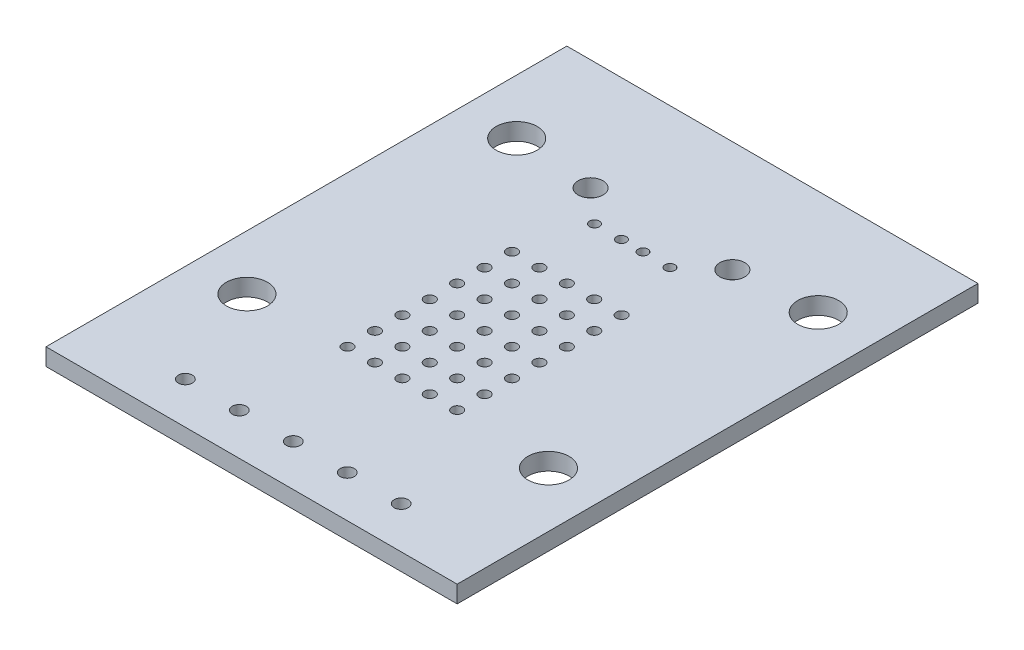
ISO-10303-21;
HEADER;
FILE_DESCRIPTION(('STEP AP214'),'2;1');
FILE_NAME('part.step','',(''),(''),'','','');
FILE_SCHEMA(('AUTOMOTIVE_DESIGN { 1 0 10303 214 1 1 1 1 }'));
ENDSEC;
DATA;
#1=APPLICATION_CONTEXT('core data for automotive mechanical design processes');
#2=APPLICATION_PROTOCOL_DEFINITION('international standard','automotive_design',2000,#1);
#3=PRODUCT_CONTEXT('',#1,'mechanical');
#4=PRODUCT('Part','Part','',(#3));
#5=PRODUCT_RELATED_PRODUCT_CATEGORY('part','',(#4));
#6=PRODUCT_DEFINITION_FORMATION('','',#4);
#7=PRODUCT_DEFINITION_CONTEXT('part definition',#1,'design');
#8=PRODUCT_DEFINITION('design','',#6,#7);
#9=PRODUCT_DEFINITION_SHAPE('','',#8);
#10=(LENGTH_UNIT() NAMED_UNIT(*) SI_UNIT(.MILLI.,.METRE.));
#11=(NAMED_UNIT(*) PLANE_ANGLE_UNIT() SI_UNIT($,.RADIAN.));
#12=(NAMED_UNIT(*) SI_UNIT($,.STERADIAN.) SOLID_ANGLE_UNIT());
#13=UNCERTAINTY_MEASURE_WITH_UNIT(LENGTH_MEASURE(1.E-05),#10,'distance_accuracy_value','');
#14=(GEOMETRIC_REPRESENTATION_CONTEXT(3) GLOBAL_UNCERTAINTY_ASSIGNED_CONTEXT((#13)) GLOBAL_UNIT_ASSIGNED_CONTEXT((#10,
#11,#12)) REPRESENTATION_CONTEXT('',''));
#15=CARTESIAN_POINT('',(0.,0.,0.));
#16=DIRECTION('',(0.,0.,1.));
#17=DIRECTION('',(1.,0.,0.));
#18=AXIS2_PLACEMENT_3D('',#15,#16,#17);
#19=CARTESIAN_POINT('',(-19.05,1.5875,-48.26));
#20=DIRECTION('',(1.,0.,0.));
#21=DIRECTION('',(0.,0.,-1.));
#22=AXIS2_PLACEMENT_3D('',#19,#20,#21);
#23=PLANE('',#22);
#24=DIRECTION('',(0.,0.,1.));
#25=VECTOR('',#24,1.);
#26=CARTESIAN_POINT('',(-19.05,0.,-48.26));
#27=LINE('',#26,#25);
#28=CARTESIAN_POINT('',(-19.05,0.,-48.26));
#29=VERTEX_POINT('',#28);
#30=CARTESIAN_POINT('',(-19.05,0.,0.));
#31=VERTEX_POINT('',#30);
#32=EDGE_CURVE('E96',#29,#31,#27,.T.);
#33=ORIENTED_EDGE('',*,*,#32,.T.);
#34=DIRECTION('',(0.,-1.,0.));
#35=VECTOR('',#34,1.);
#36=CARTESIAN_POINT('',(-19.05,1.5875,0.));
#37=LINE('',#36,#35);
#38=CARTESIAN_POINT('',(-19.05,1.5875,0.));
#39=VERTEX_POINT('',#38);
#40=EDGE_CURVE('E11',#39,#31,#37,.T.);
#41=ORIENTED_EDGE('',*,*,#40,.F.);
#42=DIRECTION('',(0.,0.,1.));
#43=VECTOR('',#42,1.);
#44=CARTESIAN_POINT('',(-19.05,1.5875,-48.26));
#45=LINE('',#44,#43);
#46=CARTESIAN_POINT('',(-19.05,1.5875,-48.26));
#47=VERTEX_POINT('',#46);
#48=EDGE_CURVE('E84',#47,#39,#45,.T.);
#49=ORIENTED_EDGE('',*,*,#48,.F.);
#50=DIRECTION('',(0.,-1.,0.));
#51=VECTOR('',#50,1.);
#52=CARTESIAN_POINT('',(-19.05,1.5875,-48.26));
#53=LINE('',#52,#51);
#54=EDGE_CURVE('E92',#47,#29,#53,.T.);
#55=ORIENTED_EDGE('',*,*,#54,.T.);
#56=EDGE_LOOP('',(#33,#41,#49,#55));
#57=FACE_BOUND('',#56,.T.);
#58=ADVANCED_FACE('F33',(#57),#23,.F.);
#59=CARTESIAN_POINT('',(-19.05,1.5875,0.));
#60=DIRECTION('',(0.,0.,-1.));
#61=DIRECTION('',(-1.,0.,0.));
#62=AXIS2_PLACEMENT_3D('',#59,#60,#61);
#63=PLANE('',#62);
#64=DIRECTION('',(1.,0.,0.));
#65=VECTOR('',#64,1.);
#66=CARTESIAN_POINT('',(-19.05,0.,0.));
#67=LINE('',#66,#65);
#68=CARTESIAN_POINT('',(19.05,0.,0.));
#69=VERTEX_POINT('',#68);
#70=EDGE_CURVE('E88',#31,#69,#67,.T.);
#71=ORIENTED_EDGE('',*,*,#70,.T.);
#72=DIRECTION('',(0.,-1.,0.));
#73=VECTOR('',#72,1.);
#74=CARTESIAN_POINT('',(19.05,1.5875,0.));
#75=LINE('',#74,#73);
#76=CARTESIAN_POINT('',(19.05,1.5875,0.));
#77=VERTEX_POINT('',#76);
#78=EDGE_CURVE('E41',#77,#69,#75,.T.);
#79=ORIENTED_EDGE('',*,*,#78,.F.);
#80=DIRECTION('',(1.,0.,0.));
#81=VECTOR('',#80,1.);
#82=CARTESIAN_POINT('',(-19.05,1.5875,0.));
#83=LINE('',#82,#81);
#84=EDGE_CURVE('E79',#39,#77,#83,.T.);
#85=ORIENTED_EDGE('',*,*,#84,.F.);
#86=ORIENTED_EDGE('',*,*,#40,.T.);
#87=EDGE_LOOP('',(#71,#79,#85,#86));
#88=FACE_BOUND('',#87,.T.);
#89=ADVANCED_FACE('F87',(#88),#63,.F.);
#90=CARTESIAN_POINT('',(19.05,1.5875,-48.26));
#91=DIRECTION('',(-1.,0.,0.));
#92=DIRECTION('',(0.,0.,1.));
#93=AXIS2_PLACEMENT_3D('',#90,#91,#92);
#94=PLANE('',#93);
#95=DIRECTION('',(0.,0.,-1.));
#96=VECTOR('',#95,1.);
#97=CARTESIAN_POINT('',(19.05,0.,-48.26));
#98=LINE('',#97,#96);
#99=CARTESIAN_POINT('',(19.05,0.,-48.26));
#100=VERTEX_POINT('',#99);
#101=EDGE_CURVE('E66',#69,#100,#98,.T.);
#102=ORIENTED_EDGE('',*,*,#101,.T.);
#103=DIRECTION('',(0.,-1.,0.));
#104=VECTOR('',#103,1.);
#105=CARTESIAN_POINT('',(19.05,1.5875,-48.26));
#106=LINE('',#105,#104);
#107=CARTESIAN_POINT('',(19.05,1.5875,-48.26));
#108=VERTEX_POINT('',#107);
#109=EDGE_CURVE('E89',#108,#100,#106,.T.);
#110=ORIENTED_EDGE('',*,*,#109,.F.);
#111=DIRECTION('',(0.,0.,-1.));
#112=VECTOR('',#111,1.);
#113=CARTESIAN_POINT('',(19.05,1.5875,-48.26));
#114=LINE('',#113,#112);
#115=EDGE_CURVE('E82',#77,#108,#114,.T.);
#116=ORIENTED_EDGE('',*,*,#115,.F.);
#117=ORIENTED_EDGE('',*,*,#78,.T.);
#118=EDGE_LOOP('',(#102,#110,#116,#117));
#119=FACE_BOUND('',#118,.T.);
#120=ADVANCED_FACE('F90',(#119),#94,.F.);
#121=CARTESIAN_POINT('',(-19.05,1.5875,-48.26));
#122=DIRECTION('',(0.,0.,1.));
#123=DIRECTION('',(1.,0.,0.));
#124=AXIS2_PLACEMENT_3D('',#121,#122,#123);
#125=PLANE('',#124);
#126=DIRECTION('',(-1.,0.,0.));
#127=VECTOR('',#126,1.);
#128=CARTESIAN_POINT('',(-19.05,0.,-48.26));
#129=LINE('',#128,#127);
#130=EDGE_CURVE('E72',#100,#29,#129,.T.);
#131=ORIENTED_EDGE('',*,*,#130,.T.);
#132=ORIENTED_EDGE('',*,*,#54,.F.);
#133=DIRECTION('',(-1.,0.,0.));
#134=VECTOR('',#133,1.);
#135=CARTESIAN_POINT('',(-19.05,1.5875,-48.26));
#136=LINE('',#135,#134);
#137=EDGE_CURVE('E49',#108,#47,#136,.T.);
#138=ORIENTED_EDGE('',*,*,#137,.F.);
#139=ORIENTED_EDGE('',*,*,#109,.T.);
#140=EDGE_LOOP('',(#131,#132,#138,#139));
#141=FACE_BOUND('',#140,.T.);
#142=ADVANCED_FACE('F104',(#141),#125,.F.);
#143=CARTESIAN_POINT('',(0.,1.5875,0.));
#144=DIRECTION('',(0.,1.,0.));
#145=DIRECTION('',(0.,0.,1.));
#146=AXIS2_PLACEMENT_3D('',#143,#144,#145);
#147=PLANE('',#146);
#148=CARTESIAN_POINT('',(3.50011999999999,1.5875,-35.27044));
#149=DIRECTION('',(0.,1.,0.));
#150=DIRECTION('',(0.,0.,-1.));
#151=AXIS2_PLACEMENT_3D('',#148,#149,#150);
#152=CIRCLE('',#151,0.457199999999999);
#153=CARTESIAN_POINT('',(3.50011999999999,1.5875,-35.72764));
#154=VERTEX_POINT('',#153);
#155=EDGE_CURVE('E404',#154,#154,#152,.T.);
#156=ORIENTED_EDGE('',*,*,#155,.F.);
#157=EDGE_LOOP('',(#156));
#158=FACE_BOUND('',#157,.T.);
#159=CARTESIAN_POINT('',(1.00075999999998,1.5875,-35.27044));
#160=DIRECTION('',(0.,1.,0.));
#161=DIRECTION('',(0.,0.,-1.));
#162=AXIS2_PLACEMENT_3D('',#159,#160,#161);
#163=CIRCLE('',#162,0.457199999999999);
#164=CARTESIAN_POINT('',(1.00075999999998,1.5875,-35.72764));
#165=VERTEX_POINT('',#164);
#166=EDGE_CURVE('E398',#165,#165,#163,.T.);
#167=ORIENTED_EDGE('',*,*,#166,.F.);
#168=EDGE_LOOP('',(#167));
#169=FACE_BOUND('',#168,.T.);
#170=CARTESIAN_POINT('',(6.57097999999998,1.5875,-37.98062));
#171=DIRECTION('',(0.,1.,0.));
#172=DIRECTION('',(0.,0.,-1.));
#173=AXIS2_PLACEMENT_3D('',#170,#171,#172);
#174=CIRCLE('',#173,1.15);
#175=CARTESIAN_POINT('',(6.57097999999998,1.5875,-39.13062));
#176=VERTEX_POINT('',#175);
#177=EDGE_CURVE('E392',#176,#176,#174,.T.);
#178=ORIENTED_EDGE('',*,*,#177,.F.);
#179=EDGE_LOOP('',(#178));
#180=FACE_BOUND('',#179,.T.);
#181=CARTESIAN_POINT('',(-1.00076,1.5875,-35.27044));
#182=DIRECTION('',(0.,1.,0.));
#183=DIRECTION('',(0.,0.,1.));
#184=AXIS2_PLACEMENT_3D('',#181,#182,#183);
#185=CIRCLE('',#184,0.457199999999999);
#186=CARTESIAN_POINT('',(-1.00076,1.5875,-34.81324));
#187=VERTEX_POINT('',#186);
#188=EDGE_CURVE('E386',#187,#187,#185,.T.);
#189=ORIENTED_EDGE('',*,*,#188,.F.);
#190=EDGE_LOOP('',(#189));
#191=FACE_BOUND('',#190,.T.);
#192=CARTESIAN_POINT('',(-3.50012,1.5875,-35.27044));
#193=DIRECTION('',(0.,1.,0.));
#194=DIRECTION('',(0.,0.,1.));
#195=AXIS2_PLACEMENT_3D('',#192,#193,#194);
#196=CIRCLE('',#195,0.457199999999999);
#197=CARTESIAN_POINT('',(-3.50012,1.5875,-34.81324));
#198=VERTEX_POINT('',#197);
#199=EDGE_CURVE('E380',#198,#198,#196,.T.);
#200=ORIENTED_EDGE('',*,*,#199,.F.);
#201=EDGE_LOOP('',(#200));
#202=FACE_BOUND('',#201,.T.);
#203=CARTESIAN_POINT('',(-6.57098,1.5875,-37.98062));
#204=DIRECTION('',(0.,1.,0.));
#205=DIRECTION('',(0.,0.,1.));
#206=AXIS2_PLACEMENT_3D('',#203,#204,#205);
#207=CIRCLE('',#206,1.15);
#208=CARTESIAN_POINT('',(-6.57098,1.5875,-36.83062));
#209=VERTEX_POINT('',#208);
#210=EDGE_CURVE('E374',#209,#209,#207,.T.);
#211=ORIENTED_EDGE('',*,*,#210,.F.);
#212=EDGE_LOOP('',(#211));
#213=FACE_BOUND('',#212,.T.);
#214=CARTESIAN_POINT('',(-5.08,1.5875,-29.21));
#215=DIRECTION('',(0.,1.,0.));
#216=DIRECTION('',(0.,0.,1.));
#217=AXIS2_PLACEMENT_3D('',#214,#215,#216);
#218=CIRCLE('',#217,0.495299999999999);
#219=CARTESIAN_POINT('',(-5.08,1.5875,-28.7147));
#220=VERTEX_POINT('',#219);
#221=EDGE_CURVE('E368',#220,#220,#218,.T.);
#222=ORIENTED_EDGE('',*,*,#221,.F.);
#223=EDGE_LOOP('',(#222));
#224=FACE_BOUND('',#223,.T.);
#225=CARTESIAN_POINT('',(-5.08,1.5875,-26.67));
#226=DIRECTION('',(0.,1.,0.));
#227=DIRECTION('',(0.,0.,1.));
#228=AXIS2_PLACEMENT_3D('',#225,#226,#227);
#229=CIRCLE('',#228,0.4953);
#230=CARTESIAN_POINT('',(-5.08,1.5875,-26.1747));
#231=VERTEX_POINT('',#230);
#232=EDGE_CURVE('E362',#231,#231,#229,.T.);
#233=ORIENTED_EDGE('',*,*,#232,.F.);
#234=EDGE_LOOP('',(#233));
#235=FACE_BOUND('',#234,.T.);
#236=CARTESIAN_POINT('',(-5.08,1.5875,-24.13));
#237=DIRECTION('',(0.,1.,0.));
#238=DIRECTION('',(0.,0.,1.));
#239=AXIS2_PLACEMENT_3D('',#236,#237,#238);
#240=CIRCLE('',#239,0.4953);
#241=CARTESIAN_POINT('',(-5.08,1.5875,-23.6347));
#242=VERTEX_POINT('',#241);
#243=EDGE_CURVE('E356',#242,#242,#240,.T.);
#244=ORIENTED_EDGE('',*,*,#243,.F.);
#245=EDGE_LOOP('',(#244));
#246=FACE_BOUND('',#245,.T.);
#247=CARTESIAN_POINT('',(-5.08,1.5875,-21.59));
#248=DIRECTION('',(0.,1.,0.));
#249=DIRECTION('',(0.,0.,1.));
#250=AXIS2_PLACEMENT_3D('',#247,#248,#249);
#251=CIRCLE('',#250,0.4953);
#252=CARTESIAN_POINT('',(-5.08,1.5875,-21.0947));
#253=VERTEX_POINT('',#252);
#254=EDGE_CURVE('E350',#253,#253,#251,.T.);
#255=ORIENTED_EDGE('',*,*,#254,.F.);
#256=EDGE_LOOP('',(#255));
#257=FACE_BOUND('',#256,.T.);
#258=CARTESIAN_POINT('',(-5.08,1.5875,-19.05));
#259=DIRECTION('',(0.,1.,0.));
#260=DIRECTION('',(0.,0.,1.));
#261=AXIS2_PLACEMENT_3D('',#258,#259,#260);
#262=CIRCLE('',#261,0.495299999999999);
#263=CARTESIAN_POINT('',(-5.08,1.5875,-18.5547));
#264=VERTEX_POINT('',#263);
#265=EDGE_CURVE('E344',#264,#264,#262,.T.);
#266=ORIENTED_EDGE('',*,*,#265,.F.);
#267=EDGE_LOOP('',(#266));
#268=FACE_BOUND('',#267,.T.);
#269=CARTESIAN_POINT('',(-5.08,1.5875,-16.51));
#270=DIRECTION('',(0.,1.,0.));
#271=DIRECTION('',(0.,0.,1.));
#272=AXIS2_PLACEMENT_3D('',#269,#270,#271);
#273=CIRCLE('',#272,0.4953);
#274=CARTESIAN_POINT('',(-5.08,1.5875,-16.0147));
#275=VERTEX_POINT('',#274);
#276=EDGE_CURVE('E338',#275,#275,#273,.T.);
#277=ORIENTED_EDGE('',*,*,#276,.F.);
#278=EDGE_LOOP('',(#277));
#279=FACE_BOUND('',#278,.T.);
#280=CARTESIAN_POINT('',(5.08,1.5875,-29.21));
#281=DIRECTION('',(0.,1.,0.));
#282=DIRECTION('',(0.,0.,1.));
#283=AXIS2_PLACEMENT_3D('',#280,#281,#282);
#284=CIRCLE('',#283,0.495299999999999);
#285=CARTESIAN_POINT('',(5.08,1.5875,-28.7147));
#286=VERTEX_POINT('',#285);
#287=EDGE_CURVE('E332',#286,#286,#284,.T.);
#288=ORIENTED_EDGE('',*,*,#287,.F.);
#289=EDGE_LOOP('',(#288));
#290=FACE_BOUND('',#289,.T.);
#291=CARTESIAN_POINT('',(2.54,1.5875,-29.21));
#292=DIRECTION('',(0.,1.,0.));
#293=DIRECTION('',(0.,0.,1.));
#294=AXIS2_PLACEMENT_3D('',#291,#292,#293);
#295=CIRCLE('',#294,0.495299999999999);
#296=CARTESIAN_POINT('',(2.54,1.5875,-28.7147));
#297=VERTEX_POINT('',#296);
#298=EDGE_CURVE('E326',#297,#297,#295,.T.);
#299=ORIENTED_EDGE('',*,*,#298,.F.);
#300=EDGE_LOOP('',(#299));
#301=FACE_BOUND('',#300,.T.);
#302=CARTESIAN_POINT('',(0.,1.5875,-29.21));
#303=DIRECTION('',(0.,1.,0.));
#304=DIRECTION('',(0.,0.,1.));
#305=AXIS2_PLACEMENT_3D('',#302,#303,#304);
#306=CIRCLE('',#305,0.4953);
#307=CARTESIAN_POINT('',(0.,1.5875,-28.7147));
#308=VERTEX_POINT('',#307);
#309=EDGE_CURVE('E320',#308,#308,#306,.T.);
#310=ORIENTED_EDGE('',*,*,#309,.F.);
#311=EDGE_LOOP('',(#310));
#312=FACE_BOUND('',#311,.T.);
#313=CARTESIAN_POINT('',(-2.54,1.5875,-29.21));
#314=DIRECTION('',(0.,1.,0.));
#315=DIRECTION('',(0.,0.,1.));
#316=AXIS2_PLACEMENT_3D('',#313,#314,#315);
#317=CIRCLE('',#316,0.4953);
#318=CARTESIAN_POINT('',(-2.54,1.5875,-28.7147));
#319=VERTEX_POINT('',#318);
#320=EDGE_CURVE('E314',#319,#319,#317,.T.);
#321=ORIENTED_EDGE('',*,*,#320,.F.);
#322=EDGE_LOOP('',(#321));
#323=FACE_BOUND('',#322,.T.);
#324=CARTESIAN_POINT('',(5.08,1.5875,-26.67));
#325=DIRECTION('',(0.,1.,0.));
#326=DIRECTION('',(0.,0.,1.));
#327=AXIS2_PLACEMENT_3D('',#324,#325,#326);
#328=CIRCLE('',#327,0.4953);
#329=CARTESIAN_POINT('',(5.08,1.5875,-26.1747));
#330=VERTEX_POINT('',#329);
#331=EDGE_CURVE('E308',#330,#330,#328,.T.);
#332=ORIENTED_EDGE('',*,*,#331,.F.);
#333=EDGE_LOOP('',(#332));
#334=FACE_BOUND('',#333,.T.);
#335=CARTESIAN_POINT('',(2.54,1.5875,-26.67));
#336=DIRECTION('',(0.,1.,0.));
#337=DIRECTION('',(0.,0.,1.));
#338=AXIS2_PLACEMENT_3D('',#335,#336,#337);
#339=CIRCLE('',#338,0.4953);
#340=CARTESIAN_POINT('',(2.54,1.5875,-26.1747));
#341=VERTEX_POINT('',#340);
#342=EDGE_CURVE('E302',#341,#341,#339,.T.);
#343=ORIENTED_EDGE('',*,*,#342,.F.);
#344=EDGE_LOOP('',(#343));
#345=FACE_BOUND('',#344,.T.);
#346=CARTESIAN_POINT('',(0.,1.5875,-26.67));
#347=DIRECTION('',(0.,1.,0.));
#348=DIRECTION('',(0.,0.,1.));
#349=AXIS2_PLACEMENT_3D('',#346,#347,#348);
#350=CIRCLE('',#349,0.495300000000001);
#351=CARTESIAN_POINT('',(0.,1.5875,-26.1747));
#352=VERTEX_POINT('',#351);
#353=EDGE_CURVE('E296',#352,#352,#350,.T.);
#354=ORIENTED_EDGE('',*,*,#353,.F.);
#355=EDGE_LOOP('',(#354));
#356=FACE_BOUND('',#355,.T.);
#357=CARTESIAN_POINT('',(-2.54,1.5875,-26.67));
#358=DIRECTION('',(0.,1.,0.));
#359=DIRECTION('',(0.,0.,1.));
#360=AXIS2_PLACEMENT_3D('',#357,#358,#359);
#361=CIRCLE('',#360,0.4953);
#362=CARTESIAN_POINT('',(-2.54,1.5875,-26.1747));
#363=VERTEX_POINT('',#362);
#364=EDGE_CURVE('E290',#363,#363,#361,.T.);
#365=ORIENTED_EDGE('',*,*,#364,.F.);
#366=EDGE_LOOP('',(#365));
#367=FACE_BOUND('',#366,.T.);
#368=CARTESIAN_POINT('',(5.08,1.5875,-24.13));
#369=DIRECTION('',(0.,1.,0.));
#370=DIRECTION('',(0.,0.,1.));
#371=AXIS2_PLACEMENT_3D('',#368,#369,#370);
#372=CIRCLE('',#371,0.4953);
#373=CARTESIAN_POINT('',(5.08,1.5875,-23.6347));
#374=VERTEX_POINT('',#373);
#375=EDGE_CURVE('E284',#374,#374,#372,.T.);
#376=ORIENTED_EDGE('',*,*,#375,.F.);
#377=EDGE_LOOP('',(#376));
#378=FACE_BOUND('',#377,.T.);
#379=CARTESIAN_POINT('',(2.54,1.5875,-24.13));
#380=DIRECTION('',(0.,1.,0.));
#381=DIRECTION('',(0.,0.,1.));
#382=AXIS2_PLACEMENT_3D('',#379,#380,#381);
#383=CIRCLE('',#382,0.4953);
#384=CARTESIAN_POINT('',(2.54,1.5875,-23.6347));
#385=VERTEX_POINT('',#384);
#386=EDGE_CURVE('E278',#385,#385,#383,.T.);
#387=ORIENTED_EDGE('',*,*,#386,.F.);
#388=EDGE_LOOP('',(#387));
#389=FACE_BOUND('',#388,.T.);
#390=CARTESIAN_POINT('',(0.,1.5875,-24.13));
#391=DIRECTION('',(0.,1.,0.));
#392=DIRECTION('',(0.,0.,1.));
#393=AXIS2_PLACEMENT_3D('',#390,#391,#392);
#394=CIRCLE('',#393,0.495300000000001);
#395=CARTESIAN_POINT('',(0.,1.5875,-23.6347));
#396=VERTEX_POINT('',#395);
#397=EDGE_CURVE('E272',#396,#396,#394,.T.);
#398=ORIENTED_EDGE('',*,*,#397,.F.);
#399=EDGE_LOOP('',(#398));
#400=FACE_BOUND('',#399,.T.);
#401=CARTESIAN_POINT('',(-2.54,1.5875,-24.13));
#402=DIRECTION('',(0.,1.,0.));
#403=DIRECTION('',(0.,0.,1.));
#404=AXIS2_PLACEMENT_3D('',#401,#402,#403);
#405=CIRCLE('',#404,0.4953);
#406=CARTESIAN_POINT('',(-2.54,1.5875,-23.6347));
#407=VERTEX_POINT('',#406);
#408=EDGE_CURVE('E266',#407,#407,#405,.T.);
#409=ORIENTED_EDGE('',*,*,#408,.F.);
#410=EDGE_LOOP('',(#409));
#411=FACE_BOUND('',#410,.T.);
#412=CARTESIAN_POINT('',(5.08,1.5875,-21.59));
#413=DIRECTION('',(0.,1.,0.));
#414=DIRECTION('',(0.,0.,1.));
#415=AXIS2_PLACEMENT_3D('',#412,#413,#414);
#416=CIRCLE('',#415,0.4953);
#417=CARTESIAN_POINT('',(5.08,1.5875,-21.0947));
#418=VERTEX_POINT('',#417);
#419=EDGE_CURVE('E260',#418,#418,#416,.T.);
#420=ORIENTED_EDGE('',*,*,#419,.F.);
#421=EDGE_LOOP('',(#420));
#422=FACE_BOUND('',#421,.T.);
#423=CARTESIAN_POINT('',(2.54,1.5875,-21.59));
#424=DIRECTION('',(0.,1.,0.));
#425=DIRECTION('',(0.,0.,1.));
#426=AXIS2_PLACEMENT_3D('',#423,#424,#425);
#427=CIRCLE('',#426,0.4953);
#428=CARTESIAN_POINT('',(2.54,1.5875,-21.0947));
#429=VERTEX_POINT('',#428);
#430=EDGE_CURVE('E254',#429,#429,#427,.T.);
#431=ORIENTED_EDGE('',*,*,#430,.F.);
#432=EDGE_LOOP('',(#431));
#433=FACE_BOUND('',#432,.T.);
#434=CARTESIAN_POINT('',(0.,1.5875,-21.59));
#435=DIRECTION('',(0.,1.,0.));
#436=DIRECTION('',(0.,0.,1.));
#437=AXIS2_PLACEMENT_3D('',#434,#435,#436);
#438=CIRCLE('',#437,0.495300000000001);
#439=CARTESIAN_POINT('',(0.,1.5875,-21.0947));
#440=VERTEX_POINT('',#439);
#441=EDGE_CURVE('E248',#440,#440,#438,.T.);
#442=ORIENTED_EDGE('',*,*,#441,.F.);
#443=EDGE_LOOP('',(#442));
#444=FACE_BOUND('',#443,.T.);
#445=CARTESIAN_POINT('',(-2.54,1.5875,-21.59));
#446=DIRECTION('',(0.,1.,0.));
#447=DIRECTION('',(0.,0.,1.));
#448=AXIS2_PLACEMENT_3D('',#445,#446,#447);
#449=CIRCLE('',#448,0.4953);
#450=CARTESIAN_POINT('',(-2.54,1.5875,-21.0947));
#451=VERTEX_POINT('',#450);
#452=EDGE_CURVE('E242',#451,#451,#449,.T.);
#453=ORIENTED_EDGE('',*,*,#452,.F.);
#454=EDGE_LOOP('',(#453));
#455=FACE_BOUND('',#454,.T.);
#456=CARTESIAN_POINT('',(5.08,1.5875,-19.05));
#457=DIRECTION('',(0.,1.,0.));
#458=DIRECTION('',(0.,0.,1.));
#459=AXIS2_PLACEMENT_3D('',#456,#457,#458);
#460=CIRCLE('',#459,0.495299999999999);
#461=CARTESIAN_POINT('',(5.08,1.5875,-18.5547));
#462=VERTEX_POINT('',#461);
#463=EDGE_CURVE('E236',#462,#462,#460,.T.);
#464=ORIENTED_EDGE('',*,*,#463,.F.);
#465=EDGE_LOOP('',(#464));
#466=FACE_BOUND('',#465,.T.);
#467=CARTESIAN_POINT('',(2.54,1.5875,-19.05));
#468=DIRECTION('',(0.,1.,0.));
#469=DIRECTION('',(0.,0.,1.));
#470=AXIS2_PLACEMENT_3D('',#467,#468,#469);
#471=CIRCLE('',#470,0.495299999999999);
#472=CARTESIAN_POINT('',(2.54,1.5875,-18.5547));
#473=VERTEX_POINT('',#472);
#474=EDGE_CURVE('E230',#473,#473,#471,.T.);
#475=ORIENTED_EDGE('',*,*,#474,.F.);
#476=EDGE_LOOP('',(#475));
#477=FACE_BOUND('',#476,.T.);
#478=CARTESIAN_POINT('',(0.,1.5875,-19.05));
#479=DIRECTION('',(0.,1.,0.));
#480=DIRECTION('',(0.,0.,1.));
#481=AXIS2_PLACEMENT_3D('',#478,#479,#480);
#482=CIRCLE('',#481,0.4953);
#483=CARTESIAN_POINT('',(0.,1.5875,-18.5547));
#484=VERTEX_POINT('',#483);
#485=EDGE_CURVE('E224',#484,#484,#482,.T.);
#486=ORIENTED_EDGE('',*,*,#485,.F.);
#487=EDGE_LOOP('',(#486));
#488=FACE_BOUND('',#487,.T.);
#489=CARTESIAN_POINT('',(-2.54,1.5875,-19.05));
#490=DIRECTION('',(0.,1.,0.));
#491=DIRECTION('',(0.,0.,1.));
#492=AXIS2_PLACEMENT_3D('',#489,#490,#491);
#493=CIRCLE('',#492,0.4953);
#494=CARTESIAN_POINT('',(-2.54,1.5875,-18.5547));
#495=VERTEX_POINT('',#494);
#496=EDGE_CURVE('E218',#495,#495,#493,.T.);
#497=ORIENTED_EDGE('',*,*,#496,.F.);
#498=EDGE_LOOP('',(#497));
#499=FACE_BOUND('',#498,.T.);
#500=CARTESIAN_POINT('',(5.08,1.5875,-16.51));
#501=DIRECTION('',(0.,1.,0.));
#502=DIRECTION('',(0.,0.,1.));
#503=AXIS2_PLACEMENT_3D('',#500,#501,#502);
#504=CIRCLE('',#503,0.4953);
#505=CARTESIAN_POINT('',(5.08,1.5875,-16.0147));
#506=VERTEX_POINT('',#505);
#507=EDGE_CURVE('E212',#506,#506,#504,.T.);
#508=ORIENTED_EDGE('',*,*,#507,.F.);
#509=EDGE_LOOP('',(#508));
#510=FACE_BOUND('',#509,.T.);
#511=CARTESIAN_POINT('',(2.54,1.5875,-16.51));
#512=DIRECTION('',(0.,1.,0.));
#513=DIRECTION('',(0.,0.,1.));
#514=AXIS2_PLACEMENT_3D('',#511,#512,#513);
#515=CIRCLE('',#514,0.4953);
#516=CARTESIAN_POINT('',(2.54,1.5875,-16.0147));
#517=VERTEX_POINT('',#516);
#518=EDGE_CURVE('E206',#517,#517,#515,.T.);
#519=ORIENTED_EDGE('',*,*,#518,.F.);
#520=EDGE_LOOP('',(#519));
#521=FACE_BOUND('',#520,.T.);
#522=CARTESIAN_POINT('',(0.,1.5875,-16.51));
#523=DIRECTION('',(0.,1.,0.));
#524=DIRECTION('',(0.,0.,1.));
#525=AXIS2_PLACEMENT_3D('',#522,#523,#524);
#526=CIRCLE('',#525,0.4953);
#527=CARTESIAN_POINT('',(0.,1.5875,-16.0147));
#528=VERTEX_POINT('',#527);
#529=EDGE_CURVE('E200',#528,#528,#526,.T.);
#530=ORIENTED_EDGE('',*,*,#529,.F.);
#531=EDGE_LOOP('',(#530));
#532=FACE_BOUND('',#531,.T.);
#533=CARTESIAN_POINT('',(-2.54,1.5875,-16.51));
#534=DIRECTION('',(0.,1.,0.));
#535=DIRECTION('',(0.,0.,1.));
#536=AXIS2_PLACEMENT_3D('',#533,#534,#535);
#537=CIRCLE('',#536,0.4953);
#538=CARTESIAN_POINT('',(-2.54,1.5875,-16.0147));
#539=VERTEX_POINT('',#538);
#540=EDGE_CURVE('E194',#539,#539,#537,.T.);
#541=ORIENTED_EDGE('',*,*,#540,.F.);
#542=EDGE_LOOP('',(#541));
#543=FACE_BOUND('',#542,.T.);
#544=CARTESIAN_POINT('',(5.08,1.5875,-13.97));
#545=DIRECTION('',(0.,1.,0.));
#546=DIRECTION('',(0.,0.,1.));
#547=AXIS2_PLACEMENT_3D('',#544,#545,#546);
#548=CIRCLE('',#547,0.495299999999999);
#549=CARTESIAN_POINT('',(5.08,1.5875,-13.4747));
#550=VERTEX_POINT('',#549);
#551=EDGE_CURVE('E188',#550,#550,#548,.T.);
#552=ORIENTED_EDGE('',*,*,#551,.F.);
#553=EDGE_LOOP('',(#552));
#554=FACE_BOUND('',#553,.T.);
#555=CARTESIAN_POINT('',(2.54,1.5875,-13.97));
#556=DIRECTION('',(0.,1.,0.));
#557=DIRECTION('',(0.,0.,1.));
#558=AXIS2_PLACEMENT_3D('',#555,#556,#557);
#559=CIRCLE('',#558,0.495299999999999);
#560=CARTESIAN_POINT('',(2.54,1.5875,-13.4747));
#561=VERTEX_POINT('',#560);
#562=EDGE_CURVE('E182',#561,#561,#559,.T.);
#563=ORIENTED_EDGE('',*,*,#562,.F.);
#564=EDGE_LOOP('',(#563));
#565=FACE_BOUND('',#564,.T.);
#566=CARTESIAN_POINT('',(0.,1.5875,-13.97));
#567=DIRECTION('',(0.,1.,0.));
#568=DIRECTION('',(0.,0.,1.));
#569=AXIS2_PLACEMENT_3D('',#566,#567,#568);
#570=CIRCLE('',#569,0.495299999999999);
#571=CARTESIAN_POINT('',(0.,1.5875,-13.4747));
#572=VERTEX_POINT('',#571);
#573=EDGE_CURVE('E176',#572,#572,#570,.T.);
#574=ORIENTED_EDGE('',*,*,#573,.F.);
#575=EDGE_LOOP('',(#574));
#576=FACE_BOUND('',#575,.T.);
#577=CARTESIAN_POINT('',(-2.54,1.5875,-13.97));
#578=DIRECTION('',(0.,1.,0.));
#579=DIRECTION('',(0.,0.,1.));
#580=AXIS2_PLACEMENT_3D('',#577,#578,#579);
#581=CIRCLE('',#580,0.495299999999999);
#582=CARTESIAN_POINT('',(-2.54,1.5875,-13.4747));
#583=VERTEX_POINT('',#582);
#584=EDGE_CURVE('E170',#583,#583,#581,.T.);
#585=ORIENTED_EDGE('',*,*,#584,.F.);
#586=EDGE_LOOP('',(#585));
#587=FACE_BOUND('',#586,.T.);
#588=CARTESIAN_POINT('',(-5.08,1.5875,-13.97));
#589=DIRECTION('',(0.,1.,0.));
#590=DIRECTION('',(0.,0.,1.));
#591=AXIS2_PLACEMENT_3D('',#588,#589,#590);
#592=CIRCLE('',#591,0.495299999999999);
#593=CARTESIAN_POINT('',(-5.08,1.5875,-13.4747));
#594=VERTEX_POINT('',#593);
#595=EDGE_CURVE('E164',#594,#594,#592,.T.);
#596=ORIENTED_EDGE('',*,*,#595,.F.);
#597=EDGE_LOOP('',(#596));
#598=FACE_BOUND('',#597,.T.);
#599=CARTESIAN_POINT('',(9.99998,1.5875,-3.86334));
#600=DIRECTION('',(0.,1.,0.));
#601=DIRECTION('',(0.,0.,-1.));
#602=AXIS2_PLACEMENT_3D('',#599,#600,#601);
#603=CIRCLE('',#602,0.649999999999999);
#604=CARTESIAN_POINT('',(9.99998,1.5875,-4.51334));
#605=VERTEX_POINT('',#604);
#606=EDGE_CURVE('E158',#605,#605,#603,.T.);
#607=ORIENTED_EDGE('',*,*,#606,.F.);
#608=EDGE_LOOP('',(#607));
#609=FACE_BOUND('',#608,.T.);
#610=CARTESIAN_POINT('',(5.00126,1.5875,-3.86334));
#611=DIRECTION('',(0.,1.,0.));
#612=DIRECTION('',(0.,0.,-1.));
#613=AXIS2_PLACEMENT_3D('',#610,#611,#612);
#614=CIRCLE('',#613,0.65);
#615=CARTESIAN_POINT('',(5.00126,1.5875,-4.51334));
#616=VERTEX_POINT('',#615);
#617=EDGE_CURVE('E152',#616,#616,#614,.T.);
#618=ORIENTED_EDGE('',*,*,#617,.F.);
#619=EDGE_LOOP('',(#618));
#620=FACE_BOUND('',#619,.T.);
#621=CARTESIAN_POINT('',(13.97,1.5875,-13.5382));
#622=DIRECTION('',(0.,1.,0.));
#623=DIRECTION('',(0.,0.,-1.));
#624=AXIS2_PLACEMENT_3D('',#621,#622,#623);
#625=CIRCLE('',#624,1.905);
#626=CARTESIAN_POINT('',(13.97,1.5875,-15.4432));
#627=VERTEX_POINT('',#626);
#628=EDGE_CURVE('E146',#627,#627,#625,.T.);
#629=ORIENTED_EDGE('',*,*,#628,.F.);
#630=EDGE_LOOP('',(#629));
#631=FACE_BOUND('',#630,.T.);
#632=CARTESIAN_POINT('',(13.97,1.5875,-38.53434));
#633=DIRECTION('',(0.,1.,0.));
#634=DIRECTION('',(0.,0.,-1.));
#635=AXIS2_PLACEMENT_3D('',#632,#633,#634);
#636=CIRCLE('',#635,1.905);
#637=CARTESIAN_POINT('',(13.97,1.5875,-40.43934));
#638=VERTEX_POINT('',#637);
#639=EDGE_CURVE('E140',#638,#638,#636,.T.);
#640=ORIENTED_EDGE('',*,*,#639,.F.);
#641=EDGE_LOOP('',(#640));
#642=FACE_BOUND('',#641,.T.);
#643=CARTESIAN_POINT('',(0.,1.5875,-3.86334));
#644=DIRECTION('',(0.,1.,0.));
#645=DIRECTION('',(0.,0.,1.));
#646=AXIS2_PLACEMENT_3D('',#643,#644,#645);
#647=CIRCLE('',#646,0.65);
#648=CARTESIAN_POINT('',(0.,1.5875,-3.21334));
#649=VERTEX_POINT('',#648);
#650=EDGE_CURVE('E134',#649,#649,#647,.T.);
#651=ORIENTED_EDGE('',*,*,#650,.F.);
#652=EDGE_LOOP('',(#651));
#653=FACE_BOUND('',#652,.T.);
#654=CARTESIAN_POINT('',(-5.00126,1.5875,-3.86334));
#655=DIRECTION('',(0.,1.,0.));
#656=DIRECTION('',(0.,0.,1.));
#657=AXIS2_PLACEMENT_3D('',#654,#655,#656);
#658=CIRCLE('',#657,0.65);
#659=CARTESIAN_POINT('',(-5.00126,1.5875,-3.21334));
#660=VERTEX_POINT('',#659);
#661=EDGE_CURVE('E128',#660,#660,#658,.T.);
#662=ORIENTED_EDGE('',*,*,#661,.F.);
#663=EDGE_LOOP('',(#662));
#664=FACE_BOUND('',#663,.T.);
#665=CARTESIAN_POINT('',(-9.99998,1.5875,-3.86334));
#666=DIRECTION('',(0.,1.,0.));
#667=DIRECTION('',(0.,0.,1.));
#668=AXIS2_PLACEMENT_3D('',#665,#666,#667);
#669=CIRCLE('',#668,0.649999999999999);
#670=CARTESIAN_POINT('',(-9.99998,1.5875,-3.21334));
#671=VERTEX_POINT('',#670);
#672=EDGE_CURVE('E122',#671,#671,#669,.T.);
#673=ORIENTED_EDGE('',*,*,#672,.F.);
#674=EDGE_LOOP('',(#673));
#675=FACE_BOUND('',#674,.T.);
#676=CARTESIAN_POINT('',(-13.97,1.5875,-38.53434));
#677=DIRECTION('',(0.,1.,0.));
#678=DIRECTION('',(0.,0.,1.));
#679=AXIS2_PLACEMENT_3D('',#676,#677,#678);
#680=CIRCLE('',#679,1.905);
#681=CARTESIAN_POINT('',(-13.97,1.5875,-36.62934));
#682=VERTEX_POINT('',#681);
#683=EDGE_CURVE('E116',#682,#682,#680,.T.);
#684=ORIENTED_EDGE('',*,*,#683,.F.);
#685=EDGE_LOOP('',(#684));
#686=FACE_BOUND('',#685,.T.);
#687=CARTESIAN_POINT('',(-13.97,1.5875,-13.5382));
#688=DIRECTION('',(0.,1.,0.));
#689=DIRECTION('',(0.,0.,1.));
#690=AXIS2_PLACEMENT_3D('',#687,#688,#689);
#691=CIRCLE('',#690,1.905);
#692=CARTESIAN_POINT('',(-13.97,1.5875,-11.6332));
#693=VERTEX_POINT('',#692);
#694=EDGE_CURVE('E110',#693,#693,#691,.T.);
#695=ORIENTED_EDGE('',*,*,#694,.F.);
#696=EDGE_LOOP('',(#695));
#697=FACE_BOUND('',#696,.T.);
#698=ORIENTED_EDGE('',*,*,#48,.T.);
#699=ORIENTED_EDGE('',*,*,#84,.T.);
#700=ORIENTED_EDGE('',*,*,#115,.T.);
#701=ORIENTED_EDGE('',*,*,#137,.T.);
#702=EDGE_LOOP('',(#698,#699,#700,#701));
#703=FACE_BOUND('',#702,.T.);
#704=ADVANCED_FACE('F80',(#158,#169,#180,#191,#202,#213,#224,#235,#246,#257,#268,#279,#290,#301,
#312,#323,#334,#345,#356,#367,#378,#389,#400,#411,#422,#433,#444,#455,#466,#477,#488,#499,#510,
#521,#532,#543,#554,#565,#576,#587,#598,#609,#620,#631,#642,#653,#664,#675,#686,#697,#703),#147,.T.);
#705=CARTESIAN_POINT('',(0.,0.,0.));
#706=DIRECTION('',(0.,1.,0.));
#707=DIRECTION('',(0.,0.,1.));
#708=AXIS2_PLACEMENT_3D('',#705,#706,#707);
#709=PLANE('',#708);
#710=CARTESIAN_POINT('',(3.50011999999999,0.,-35.27044));
#711=DIRECTION('',(0.,1.,0.));
#712=DIRECTION('',(0.,0.,-1.));
#713=AXIS2_PLACEMENT_3D('',#710,#711,#712);
#714=CIRCLE('',#713,0.457199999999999);
#715=CARTESIAN_POINT('',(3.50011999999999,0.,-35.72764));
#716=VERTEX_POINT('',#715);
#717=EDGE_CURVE('E401',#716,#716,#714,.T.);
#718=ORIENTED_EDGE('',*,*,#717,.T.);
#719=EDGE_LOOP('',(#718));
#720=FACE_BOUND('',#719,.T.);
#721=CARTESIAN_POINT('',(1.00075999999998,0.,-35.27044));
#722=DIRECTION('',(0.,1.,0.));
#723=DIRECTION('',(0.,0.,-1.));
#724=AXIS2_PLACEMENT_3D('',#721,#722,#723);
#725=CIRCLE('',#724,0.457199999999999);
#726=CARTESIAN_POINT('',(1.00075999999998,0.,-35.72764));
#727=VERTEX_POINT('',#726);
#728=EDGE_CURVE('E395',#727,#727,#725,.T.);
#729=ORIENTED_EDGE('',*,*,#728,.T.);
#730=EDGE_LOOP('',(#729));
#731=FACE_BOUND('',#730,.T.);
#732=CARTESIAN_POINT('',(6.57097999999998,0.,-37.98062));
#733=DIRECTION('',(0.,1.,0.));
#734=DIRECTION('',(0.,0.,-1.));
#735=AXIS2_PLACEMENT_3D('',#732,#733,#734);
#736=CIRCLE('',#735,1.15);
#737=CARTESIAN_POINT('',(6.57097999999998,0.,-39.13062));
#738=VERTEX_POINT('',#737);
#739=EDGE_CURVE('E389',#738,#738,#736,.T.);
#740=ORIENTED_EDGE('',*,*,#739,.T.);
#741=EDGE_LOOP('',(#740));
#742=FACE_BOUND('',#741,.T.);
#743=CARTESIAN_POINT('',(-1.00076,0.,-35.27044));
#744=DIRECTION('',(0.,1.,0.));
#745=DIRECTION('',(0.,0.,1.));
#746=AXIS2_PLACEMENT_3D('',#743,#744,#745);
#747=CIRCLE('',#746,0.457199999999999);
#748=CARTESIAN_POINT('',(-1.00076,0.,-34.81324));
#749=VERTEX_POINT('',#748);
#750=EDGE_CURVE('E383',#749,#749,#747,.T.);
#751=ORIENTED_EDGE('',*,*,#750,.T.);
#752=EDGE_LOOP('',(#751));
#753=FACE_BOUND('',#752,.T.);
#754=CARTESIAN_POINT('',(-3.50012,0.,-35.27044));
#755=DIRECTION('',(0.,1.,0.));
#756=DIRECTION('',(0.,0.,1.));
#757=AXIS2_PLACEMENT_3D('',#754,#755,#756);
#758=CIRCLE('',#757,0.457199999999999);
#759=CARTESIAN_POINT('',(-3.50012,0.,-34.81324));
#760=VERTEX_POINT('',#759);
#761=EDGE_CURVE('E377',#760,#760,#758,.T.);
#762=ORIENTED_EDGE('',*,*,#761,.T.);
#763=EDGE_LOOP('',(#762));
#764=FACE_BOUND('',#763,.T.);
#765=CARTESIAN_POINT('',(-6.57098,0.,-37.98062));
#766=DIRECTION('',(0.,1.,0.));
#767=DIRECTION('',(0.,0.,1.));
#768=AXIS2_PLACEMENT_3D('',#765,#766,#767);
#769=CIRCLE('',#768,1.15);
#770=CARTESIAN_POINT('',(-6.57098,0.,-36.83062));
#771=VERTEX_POINT('',#770);
#772=EDGE_CURVE('E371',#771,#771,#769,.T.);
#773=ORIENTED_EDGE('',*,*,#772,.T.);
#774=EDGE_LOOP('',(#773));
#775=FACE_BOUND('',#774,.T.);
#776=CARTESIAN_POINT('',(-5.08,0.,-29.21));
#777=DIRECTION('',(0.,1.,0.));
#778=DIRECTION('',(0.,0.,1.));
#779=AXIS2_PLACEMENT_3D('',#776,#777,#778);
#780=CIRCLE('',#779,0.495299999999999);
#781=CARTESIAN_POINT('',(-5.08,0.,-28.7147));
#782=VERTEX_POINT('',#781);
#783=EDGE_CURVE('E365',#782,#782,#780,.T.);
#784=ORIENTED_EDGE('',*,*,#783,.T.);
#785=EDGE_LOOP('',(#784));
#786=FACE_BOUND('',#785,.T.);
#787=CARTESIAN_POINT('',(-5.08,0.,-26.67));
#788=DIRECTION('',(0.,1.,0.));
#789=DIRECTION('',(0.,0.,1.));
#790=AXIS2_PLACEMENT_3D('',#787,#788,#789);
#791=CIRCLE('',#790,0.4953);
#792=CARTESIAN_POINT('',(-5.08,0.,-26.1747));
#793=VERTEX_POINT('',#792);
#794=EDGE_CURVE('E359',#793,#793,#791,.T.);
#795=ORIENTED_EDGE('',*,*,#794,.T.);
#796=EDGE_LOOP('',(#795));
#797=FACE_BOUND('',#796,.T.);
#798=CARTESIAN_POINT('',(-5.08,0.,-24.13));
#799=DIRECTION('',(0.,1.,0.));
#800=DIRECTION('',(0.,0.,1.));
#801=AXIS2_PLACEMENT_3D('',#798,#799,#800);
#802=CIRCLE('',#801,0.4953);
#803=CARTESIAN_POINT('',(-5.08,0.,-23.6347));
#804=VERTEX_POINT('',#803);
#805=EDGE_CURVE('E353',#804,#804,#802,.T.);
#806=ORIENTED_EDGE('',*,*,#805,.T.);
#807=EDGE_LOOP('',(#806));
#808=FACE_BOUND('',#807,.T.);
#809=CARTESIAN_POINT('',(-5.08,0.,-21.59));
#810=DIRECTION('',(0.,1.,0.));
#811=DIRECTION('',(0.,0.,1.));
#812=AXIS2_PLACEMENT_3D('',#809,#810,#811);
#813=CIRCLE('',#812,0.4953);
#814=CARTESIAN_POINT('',(-5.08,0.,-21.0947));
#815=VERTEX_POINT('',#814);
#816=EDGE_CURVE('E347',#815,#815,#813,.T.);
#817=ORIENTED_EDGE('',*,*,#816,.T.);
#818=EDGE_LOOP('',(#817));
#819=FACE_BOUND('',#818,.T.);
#820=CARTESIAN_POINT('',(-5.08,0.,-19.05));
#821=DIRECTION('',(0.,1.,0.));
#822=DIRECTION('',(0.,0.,1.));
#823=AXIS2_PLACEMENT_3D('',#820,#821,#822);
#824=CIRCLE('',#823,0.495299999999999);
#825=CARTESIAN_POINT('',(-5.08,0.,-18.5547));
#826=VERTEX_POINT('',#825);
#827=EDGE_CURVE('E341',#826,#826,#824,.T.);
#828=ORIENTED_EDGE('',*,*,#827,.T.);
#829=EDGE_LOOP('',(#828));
#830=FACE_BOUND('',#829,.T.);
#831=CARTESIAN_POINT('',(-5.08,0.,-16.51));
#832=DIRECTION('',(0.,1.,0.));
#833=DIRECTION('',(0.,0.,1.));
#834=AXIS2_PLACEMENT_3D('',#831,#832,#833);
#835=CIRCLE('',#834,0.4953);
#836=CARTESIAN_POINT('',(-5.08,0.,-16.0147));
#837=VERTEX_POINT('',#836);
#838=EDGE_CURVE('E335',#837,#837,#835,.T.);
#839=ORIENTED_EDGE('',*,*,#838,.T.);
#840=EDGE_LOOP('',(#839));
#841=FACE_BOUND('',#840,.T.);
#842=CARTESIAN_POINT('',(5.08,0.,-29.21));
#843=DIRECTION('',(0.,1.,0.));
#844=DIRECTION('',(0.,0.,1.));
#845=AXIS2_PLACEMENT_3D('',#842,#843,#844);
#846=CIRCLE('',#845,0.495299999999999);
#847=CARTESIAN_POINT('',(5.08,0.,-28.7147));
#848=VERTEX_POINT('',#847);
#849=EDGE_CURVE('E329',#848,#848,#846,.T.);
#850=ORIENTED_EDGE('',*,*,#849,.T.);
#851=EDGE_LOOP('',(#850));
#852=FACE_BOUND('',#851,.T.);
#853=CARTESIAN_POINT('',(2.54,0.,-29.21));
#854=DIRECTION('',(0.,1.,0.));
#855=DIRECTION('',(0.,0.,1.));
#856=AXIS2_PLACEMENT_3D('',#853,#854,#855);
#857=CIRCLE('',#856,0.495299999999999);
#858=CARTESIAN_POINT('',(2.54,0.,-28.7147));
#859=VERTEX_POINT('',#858);
#860=EDGE_CURVE('E323',#859,#859,#857,.T.);
#861=ORIENTED_EDGE('',*,*,#860,.T.);
#862=EDGE_LOOP('',(#861));
#863=FACE_BOUND('',#862,.T.);
#864=CARTESIAN_POINT('',(0.,0.,-29.21));
#865=DIRECTION('',(0.,1.,0.));
#866=DIRECTION('',(0.,0.,1.));
#867=AXIS2_PLACEMENT_3D('',#864,#865,#866);
#868=CIRCLE('',#867,0.4953);
#869=CARTESIAN_POINT('',(0.,0.,-28.7147));
#870=VERTEX_POINT('',#869);
#871=EDGE_CURVE('E317',#870,#870,#868,.T.);
#872=ORIENTED_EDGE('',*,*,#871,.T.);
#873=EDGE_LOOP('',(#872));
#874=FACE_BOUND('',#873,.T.);
#875=CARTESIAN_POINT('',(-2.54,0.,-29.21));
#876=DIRECTION('',(0.,1.,0.));
#877=DIRECTION('',(0.,0.,1.));
#878=AXIS2_PLACEMENT_3D('',#875,#876,#877);
#879=CIRCLE('',#878,0.4953);
#880=CARTESIAN_POINT('',(-2.54,0.,-28.7147));
#881=VERTEX_POINT('',#880);
#882=EDGE_CURVE('E311',#881,#881,#879,.T.);
#883=ORIENTED_EDGE('',*,*,#882,.T.);
#884=EDGE_LOOP('',(#883));
#885=FACE_BOUND('',#884,.T.);
#886=CARTESIAN_POINT('',(5.08,0.,-26.67));
#887=DIRECTION('',(0.,1.,0.));
#888=DIRECTION('',(0.,0.,1.));
#889=AXIS2_PLACEMENT_3D('',#886,#887,#888);
#890=CIRCLE('',#889,0.4953);
#891=CARTESIAN_POINT('',(5.08,0.,-26.1747));
#892=VERTEX_POINT('',#891);
#893=EDGE_CURVE('E305',#892,#892,#890,.T.);
#894=ORIENTED_EDGE('',*,*,#893,.T.);
#895=EDGE_LOOP('',(#894));
#896=FACE_BOUND('',#895,.T.);
#897=CARTESIAN_POINT('',(2.54,0.,-26.67));
#898=DIRECTION('',(0.,1.,0.));
#899=DIRECTION('',(0.,0.,1.));
#900=AXIS2_PLACEMENT_3D('',#897,#898,#899);
#901=CIRCLE('',#900,0.4953);
#902=CARTESIAN_POINT('',(2.54,0.,-26.1747));
#903=VERTEX_POINT('',#902);
#904=EDGE_CURVE('E299',#903,#903,#901,.T.);
#905=ORIENTED_EDGE('',*,*,#904,.T.);
#906=EDGE_LOOP('',(#905));
#907=FACE_BOUND('',#906,.T.);
#908=CARTESIAN_POINT('',(0.,0.,-26.67));
#909=DIRECTION('',(0.,1.,0.));
#910=DIRECTION('',(0.,0.,1.));
#911=AXIS2_PLACEMENT_3D('',#908,#909,#910);
#912=CIRCLE('',#911,0.495300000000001);
#913=CARTESIAN_POINT('',(0.,0.,-26.1747));
#914=VERTEX_POINT('',#913);
#915=EDGE_CURVE('E293',#914,#914,#912,.T.);
#916=ORIENTED_EDGE('',*,*,#915,.T.);
#917=EDGE_LOOP('',(#916));
#918=FACE_BOUND('',#917,.T.);
#919=CARTESIAN_POINT('',(-2.54,0.,-26.67));
#920=DIRECTION('',(0.,1.,0.));
#921=DIRECTION('',(0.,0.,1.));
#922=AXIS2_PLACEMENT_3D('',#919,#920,#921);
#923=CIRCLE('',#922,0.4953);
#924=CARTESIAN_POINT('',(-2.54,0.,-26.1747));
#925=VERTEX_POINT('',#924);
#926=EDGE_CURVE('E287',#925,#925,#923,.T.);
#927=ORIENTED_EDGE('',*,*,#926,.T.);
#928=EDGE_LOOP('',(#927));
#929=FACE_BOUND('',#928,.T.);
#930=CARTESIAN_POINT('',(5.08,0.,-24.13));
#931=DIRECTION('',(0.,1.,0.));
#932=DIRECTION('',(0.,0.,1.));
#933=AXIS2_PLACEMENT_3D('',#930,#931,#932);
#934=CIRCLE('',#933,0.4953);
#935=CARTESIAN_POINT('',(5.08,0.,-23.6347));
#936=VERTEX_POINT('',#935);
#937=EDGE_CURVE('E281',#936,#936,#934,.T.);
#938=ORIENTED_EDGE('',*,*,#937,.T.);
#939=EDGE_LOOP('',(#938));
#940=FACE_BOUND('',#939,.T.);
#941=CARTESIAN_POINT('',(2.54,0.,-24.13));
#942=DIRECTION('',(0.,1.,0.));
#943=DIRECTION('',(0.,0.,1.));
#944=AXIS2_PLACEMENT_3D('',#941,#942,#943);
#945=CIRCLE('',#944,0.4953);
#946=CARTESIAN_POINT('',(2.54,0.,-23.6347));
#947=VERTEX_POINT('',#946);
#948=EDGE_CURVE('E275',#947,#947,#945,.T.);
#949=ORIENTED_EDGE('',*,*,#948,.T.);
#950=EDGE_LOOP('',(#949));
#951=FACE_BOUND('',#950,.T.);
#952=CARTESIAN_POINT('',(0.,0.,-24.13));
#953=DIRECTION('',(0.,1.,0.));
#954=DIRECTION('',(0.,0.,1.));
#955=AXIS2_PLACEMENT_3D('',#952,#953,#954);
#956=CIRCLE('',#955,0.495300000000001);
#957=CARTESIAN_POINT('',(0.,0.,-23.6347));
#958=VERTEX_POINT('',#957);
#959=EDGE_CURVE('E269',#958,#958,#956,.T.);
#960=ORIENTED_EDGE('',*,*,#959,.T.);
#961=EDGE_LOOP('',(#960));
#962=FACE_BOUND('',#961,.T.);
#963=CARTESIAN_POINT('',(-2.54,0.,-24.13));
#964=DIRECTION('',(0.,1.,0.));
#965=DIRECTION('',(0.,0.,1.));
#966=AXIS2_PLACEMENT_3D('',#963,#964,#965);
#967=CIRCLE('',#966,0.4953);
#968=CARTESIAN_POINT('',(-2.54,0.,-23.6347));
#969=VERTEX_POINT('',#968);
#970=EDGE_CURVE('E263',#969,#969,#967,.T.);
#971=ORIENTED_EDGE('',*,*,#970,.T.);
#972=EDGE_LOOP('',(#971));
#973=FACE_BOUND('',#972,.T.);
#974=CARTESIAN_POINT('',(5.08,0.,-21.59));
#975=DIRECTION('',(0.,1.,0.));
#976=DIRECTION('',(0.,0.,1.));
#977=AXIS2_PLACEMENT_3D('',#974,#975,#976);
#978=CIRCLE('',#977,0.4953);
#979=CARTESIAN_POINT('',(5.08,0.,-21.0947));
#980=VERTEX_POINT('',#979);
#981=EDGE_CURVE('E257',#980,#980,#978,.T.);
#982=ORIENTED_EDGE('',*,*,#981,.T.);
#983=EDGE_LOOP('',(#982));
#984=FACE_BOUND('',#983,.T.);
#985=CARTESIAN_POINT('',(2.54,0.,-21.59));
#986=DIRECTION('',(0.,1.,0.));
#987=DIRECTION('',(0.,0.,1.));
#988=AXIS2_PLACEMENT_3D('',#985,#986,#987);
#989=CIRCLE('',#988,0.4953);
#990=CARTESIAN_POINT('',(2.54,0.,-21.0947));
#991=VERTEX_POINT('',#990);
#992=EDGE_CURVE('E251',#991,#991,#989,.T.);
#993=ORIENTED_EDGE('',*,*,#992,.T.);
#994=EDGE_LOOP('',(#993));
#995=FACE_BOUND('',#994,.T.);
#996=CARTESIAN_POINT('',(0.,0.,-21.59));
#997=DIRECTION('',(0.,1.,0.));
#998=DIRECTION('',(0.,0.,1.));
#999=AXIS2_PLACEMENT_3D('',#996,#997,#998);
#1000=CIRCLE('',#999,0.495300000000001);
#1001=CARTESIAN_POINT('',(0.,0.,-21.0947));
#1002=VERTEX_POINT('',#1001);
#1003=EDGE_CURVE('E245',#1002,#1002,#1000,.T.);
#1004=ORIENTED_EDGE('',*,*,#1003,.T.);
#1005=EDGE_LOOP('',(#1004));
#1006=FACE_BOUND('',#1005,.T.);
#1007=CARTESIAN_POINT('',(-2.54,0.,-21.59));
#1008=DIRECTION('',(0.,1.,0.));
#1009=DIRECTION('',(0.,0.,1.));
#1010=AXIS2_PLACEMENT_3D('',#1007,#1008,#1009);
#1011=CIRCLE('',#1010,0.4953);
#1012=CARTESIAN_POINT('',(-2.54,0.,-21.0947));
#1013=VERTEX_POINT('',#1012);
#1014=EDGE_CURVE('E239',#1013,#1013,#1011,.T.);
#1015=ORIENTED_EDGE('',*,*,#1014,.T.);
#1016=EDGE_LOOP('',(#1015));
#1017=FACE_BOUND('',#1016,.T.);
#1018=CARTESIAN_POINT('',(5.08,0.,-19.05));
#1019=DIRECTION('',(0.,1.,0.));
#1020=DIRECTION('',(0.,0.,1.));
#1021=AXIS2_PLACEMENT_3D('',#1018,#1019,#1020);
#1022=CIRCLE('',#1021,0.495299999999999);
#1023=CARTESIAN_POINT('',(5.08,0.,-18.5547));
#1024=VERTEX_POINT('',#1023);
#1025=EDGE_CURVE('E233',#1024,#1024,#1022,.T.);
#1026=ORIENTED_EDGE('',*,*,#1025,.T.);
#1027=EDGE_LOOP('',(#1026));
#1028=FACE_BOUND('',#1027,.T.);
#1029=CARTESIAN_POINT('',(2.54,0.,-19.05));
#1030=DIRECTION('',(0.,1.,0.));
#1031=DIRECTION('',(0.,0.,1.));
#1032=AXIS2_PLACEMENT_3D('',#1029,#1030,#1031);
#1033=CIRCLE('',#1032,0.495299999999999);
#1034=CARTESIAN_POINT('',(2.54,0.,-18.5547));
#1035=VERTEX_POINT('',#1034);
#1036=EDGE_CURVE('E227',#1035,#1035,#1033,.T.);
#1037=ORIENTED_EDGE('',*,*,#1036,.T.);
#1038=EDGE_LOOP('',(#1037));
#1039=FACE_BOUND('',#1038,.T.);
#1040=CARTESIAN_POINT('',(0.,0.,-19.05));
#1041=DIRECTION('',(0.,1.,0.));
#1042=DIRECTION('',(0.,0.,1.));
#1043=AXIS2_PLACEMENT_3D('',#1040,#1041,#1042);
#1044=CIRCLE('',#1043,0.4953);
#1045=CARTESIAN_POINT('',(0.,0.,-18.5547));
#1046=VERTEX_POINT('',#1045);
#1047=EDGE_CURVE('E221',#1046,#1046,#1044,.T.);
#1048=ORIENTED_EDGE('',*,*,#1047,.T.);
#1049=EDGE_LOOP('',(#1048));
#1050=FACE_BOUND('',#1049,.T.);
#1051=CARTESIAN_POINT('',(-2.54,0.,-19.05));
#1052=DIRECTION('',(0.,1.,0.));
#1053=DIRECTION('',(0.,0.,1.));
#1054=AXIS2_PLACEMENT_3D('',#1051,#1052,#1053);
#1055=CIRCLE('',#1054,0.4953);
#1056=CARTESIAN_POINT('',(-2.54,0.,-18.5547));
#1057=VERTEX_POINT('',#1056);
#1058=EDGE_CURVE('E215',#1057,#1057,#1055,.T.);
#1059=ORIENTED_EDGE('',*,*,#1058,.T.);
#1060=EDGE_LOOP('',(#1059));
#1061=FACE_BOUND('',#1060,.T.);
#1062=CARTESIAN_POINT('',(5.08,0.,-16.51));
#1063=DIRECTION('',(0.,1.,0.));
#1064=DIRECTION('',(0.,0.,1.));
#1065=AXIS2_PLACEMENT_3D('',#1062,#1063,#1064);
#1066=CIRCLE('',#1065,0.4953);
#1067=CARTESIAN_POINT('',(5.08,0.,-16.0147));
#1068=VERTEX_POINT('',#1067);
#1069=EDGE_CURVE('E209',#1068,#1068,#1066,.T.);
#1070=ORIENTED_EDGE('',*,*,#1069,.T.);
#1071=EDGE_LOOP('',(#1070));
#1072=FACE_BOUND('',#1071,.T.);
#1073=CARTESIAN_POINT('',(2.54,0.,-16.51));
#1074=DIRECTION('',(0.,1.,0.));
#1075=DIRECTION('',(0.,0.,1.));
#1076=AXIS2_PLACEMENT_3D('',#1073,#1074,#1075);
#1077=CIRCLE('',#1076,0.4953);
#1078=CARTESIAN_POINT('',(2.54,0.,-16.0147));
#1079=VERTEX_POINT('',#1078);
#1080=EDGE_CURVE('E203',#1079,#1079,#1077,.T.);
#1081=ORIENTED_EDGE('',*,*,#1080,.T.);
#1082=EDGE_LOOP('',(#1081));
#1083=FACE_BOUND('',#1082,.T.);
#1084=CARTESIAN_POINT('',(0.,0.,-16.51));
#1085=DIRECTION('',(0.,1.,0.));
#1086=DIRECTION('',(0.,0.,1.));
#1087=AXIS2_PLACEMENT_3D('',#1084,#1085,#1086);
#1088=CIRCLE('',#1087,0.4953);
#1089=CARTESIAN_POINT('',(0.,0.,-16.0147));
#1090=VERTEX_POINT('',#1089);
#1091=EDGE_CURVE('E197',#1090,#1090,#1088,.T.);
#1092=ORIENTED_EDGE('',*,*,#1091,.T.);
#1093=EDGE_LOOP('',(#1092));
#1094=FACE_BOUND('',#1093,.T.);
#1095=CARTESIAN_POINT('',(-2.54,0.,-16.51));
#1096=DIRECTION('',(0.,1.,0.));
#1097=DIRECTION('',(0.,0.,1.));
#1098=AXIS2_PLACEMENT_3D('',#1095,#1096,#1097);
#1099=CIRCLE('',#1098,0.4953);
#1100=CARTESIAN_POINT('',(-2.54,0.,-16.0147));
#1101=VERTEX_POINT('',#1100);
#1102=EDGE_CURVE('E191',#1101,#1101,#1099,.T.);
#1103=ORIENTED_EDGE('',*,*,#1102,.T.);
#1104=EDGE_LOOP('',(#1103));
#1105=FACE_BOUND('',#1104,.T.);
#1106=CARTESIAN_POINT('',(5.08,0.,-13.97));
#1107=DIRECTION('',(0.,1.,0.));
#1108=DIRECTION('',(0.,0.,1.));
#1109=AXIS2_PLACEMENT_3D('',#1106,#1107,#1108);
#1110=CIRCLE('',#1109,0.495299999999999);
#1111=CARTESIAN_POINT('',(5.08,0.,-13.4747));
#1112=VERTEX_POINT('',#1111);
#1113=EDGE_CURVE('E185',#1112,#1112,#1110,.T.);
#1114=ORIENTED_EDGE('',*,*,#1113,.T.);
#1115=EDGE_LOOP('',(#1114));
#1116=FACE_BOUND('',#1115,.T.);
#1117=CARTESIAN_POINT('',(2.54,0.,-13.97));
#1118=DIRECTION('',(0.,1.,0.));
#1119=DIRECTION('',(0.,0.,1.));
#1120=AXIS2_PLACEMENT_3D('',#1117,#1118,#1119);
#1121=CIRCLE('',#1120,0.495299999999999);
#1122=CARTESIAN_POINT('',(2.54,0.,-13.4747));
#1123=VERTEX_POINT('',#1122);
#1124=EDGE_CURVE('E179',#1123,#1123,#1121,.T.);
#1125=ORIENTED_EDGE('',*,*,#1124,.T.);
#1126=EDGE_LOOP('',(#1125));
#1127=FACE_BOUND('',#1126,.T.);
#1128=CARTESIAN_POINT('',(0.,0.,-13.97));
#1129=DIRECTION('',(0.,1.,0.));
#1130=DIRECTION('',(0.,0.,1.));
#1131=AXIS2_PLACEMENT_3D('',#1128,#1129,#1130);
#1132=CIRCLE('',#1131,0.495299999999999);
#1133=CARTESIAN_POINT('',(0.,0.,-13.4747));
#1134=VERTEX_POINT('',#1133);
#1135=EDGE_CURVE('E173',#1134,#1134,#1132,.T.);
#1136=ORIENTED_EDGE('',*,*,#1135,.T.);
#1137=EDGE_LOOP('',(#1136));
#1138=FACE_BOUND('',#1137,.T.);
#1139=CARTESIAN_POINT('',(-2.54,0.,-13.97));
#1140=DIRECTION('',(0.,1.,0.));
#1141=DIRECTION('',(0.,0.,1.));
#1142=AXIS2_PLACEMENT_3D('',#1139,#1140,#1141);
#1143=CIRCLE('',#1142,0.495299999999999);
#1144=CARTESIAN_POINT('',(-2.54,0.,-13.4747));
#1145=VERTEX_POINT('',#1144);
#1146=EDGE_CURVE('E167',#1145,#1145,#1143,.T.);
#1147=ORIENTED_EDGE('',*,*,#1146,.T.);
#1148=EDGE_LOOP('',(#1147));
#1149=FACE_BOUND('',#1148,.T.);
#1150=CARTESIAN_POINT('',(-5.08,0.,-13.97));
#1151=DIRECTION('',(0.,1.,0.));
#1152=DIRECTION('',(0.,0.,1.));
#1153=AXIS2_PLACEMENT_3D('',#1150,#1151,#1152);
#1154=CIRCLE('',#1153,0.495299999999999);
#1155=CARTESIAN_POINT('',(-5.08,0.,-13.4747));
#1156=VERTEX_POINT('',#1155);
#1157=EDGE_CURVE('E161',#1156,#1156,#1154,.T.);
#1158=ORIENTED_EDGE('',*,*,#1157,.T.);
#1159=EDGE_LOOP('',(#1158));
#1160=FACE_BOUND('',#1159,.T.);
#1161=CARTESIAN_POINT('',(9.99998,0.,-3.86334));
#1162=DIRECTION('',(0.,1.,0.));
#1163=DIRECTION('',(0.,0.,-1.));
#1164=AXIS2_PLACEMENT_3D('',#1161,#1162,#1163);
#1165=CIRCLE('',#1164,0.649999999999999);
#1166=CARTESIAN_POINT('',(9.99998,0.,-4.51334));
#1167=VERTEX_POINT('',#1166);
#1168=EDGE_CURVE('E155',#1167,#1167,#1165,.T.);
#1169=ORIENTED_EDGE('',*,*,#1168,.T.);
#1170=EDGE_LOOP('',(#1169));
#1171=FACE_BOUND('',#1170,.T.);
#1172=CARTESIAN_POINT('',(5.00126,0.,-3.86334));
#1173=DIRECTION('',(0.,1.,0.));
#1174=DIRECTION('',(0.,0.,-1.));
#1175=AXIS2_PLACEMENT_3D('',#1172,#1173,#1174);
#1176=CIRCLE('',#1175,0.65);
#1177=CARTESIAN_POINT('',(5.00126,0.,-4.51334));
#1178=VERTEX_POINT('',#1177);
#1179=EDGE_CURVE('E149',#1178,#1178,#1176,.T.);
#1180=ORIENTED_EDGE('',*,*,#1179,.T.);
#1181=EDGE_LOOP('',(#1180));
#1182=FACE_BOUND('',#1181,.T.);
#1183=CARTESIAN_POINT('',(13.97,0.,-13.5382));
#1184=DIRECTION('',(0.,1.,0.));
#1185=DIRECTION('',(0.,0.,-1.));
#1186=AXIS2_PLACEMENT_3D('',#1183,#1184,#1185);
#1187=CIRCLE('',#1186,1.905);
#1188=CARTESIAN_POINT('',(13.97,0.,-15.4432));
#1189=VERTEX_POINT('',#1188);
#1190=EDGE_CURVE('E143',#1189,#1189,#1187,.T.);
#1191=ORIENTED_EDGE('',*,*,#1190,.T.);
#1192=EDGE_LOOP('',(#1191));
#1193=FACE_BOUND('',#1192,.T.);
#1194=CARTESIAN_POINT('',(13.97,0.,-38.53434));
#1195=DIRECTION('',(0.,1.,0.));
#1196=DIRECTION('',(0.,0.,-1.));
#1197=AXIS2_PLACEMENT_3D('',#1194,#1195,#1196);
#1198=CIRCLE('',#1197,1.905);
#1199=CARTESIAN_POINT('',(13.97,0.,-40.43934));
#1200=VERTEX_POINT('',#1199);
#1201=EDGE_CURVE('E137',#1200,#1200,#1198,.T.);
#1202=ORIENTED_EDGE('',*,*,#1201,.T.);
#1203=EDGE_LOOP('',(#1202));
#1204=FACE_BOUND('',#1203,.T.);
#1205=CARTESIAN_POINT('',(0.,0.,-3.86334));
#1206=DIRECTION('',(0.,1.,0.));
#1207=DIRECTION('',(0.,0.,1.));
#1208=AXIS2_PLACEMENT_3D('',#1205,#1206,#1207);
#1209=CIRCLE('',#1208,0.65);
#1210=CARTESIAN_POINT('',(0.,0.,-3.21334));
#1211=VERTEX_POINT('',#1210);
#1212=EDGE_CURVE('E131',#1211,#1211,#1209,.T.);
#1213=ORIENTED_EDGE('',*,*,#1212,.T.);
#1214=EDGE_LOOP('',(#1213));
#1215=FACE_BOUND('',#1214,.T.);
#1216=CARTESIAN_POINT('',(-5.00126,0.,-3.86334));
#1217=DIRECTION('',(0.,1.,0.));
#1218=DIRECTION('',(0.,0.,1.));
#1219=AXIS2_PLACEMENT_3D('',#1216,#1217,#1218);
#1220=CIRCLE('',#1219,0.65);
#1221=CARTESIAN_POINT('',(-5.00126,0.,-3.21334));
#1222=VERTEX_POINT('',#1221);
#1223=EDGE_CURVE('E125',#1222,#1222,#1220,.T.);
#1224=ORIENTED_EDGE('',*,*,#1223,.T.);
#1225=EDGE_LOOP('',(#1224));
#1226=FACE_BOUND('',#1225,.T.);
#1227=CARTESIAN_POINT('',(-9.99998,0.,-3.86334));
#1228=DIRECTION('',(0.,1.,0.));
#1229=DIRECTION('',(0.,0.,1.));
#1230=AXIS2_PLACEMENT_3D('',#1227,#1228,#1229);
#1231=CIRCLE('',#1230,0.649999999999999);
#1232=CARTESIAN_POINT('',(-9.99998,0.,-3.21334));
#1233=VERTEX_POINT('',#1232);
#1234=EDGE_CURVE('E119',#1233,#1233,#1231,.T.);
#1235=ORIENTED_EDGE('',*,*,#1234,.T.);
#1236=EDGE_LOOP('',(#1235));
#1237=FACE_BOUND('',#1236,.T.);
#1238=CARTESIAN_POINT('',(-13.97,0.,-38.53434));
#1239=DIRECTION('',(0.,1.,0.));
#1240=DIRECTION('',(0.,0.,1.));
#1241=AXIS2_PLACEMENT_3D('',#1238,#1239,#1240);
#1242=CIRCLE('',#1241,1.905);
#1243=CARTESIAN_POINT('',(-13.97,0.,-36.62934));
#1244=VERTEX_POINT('',#1243);
#1245=EDGE_CURVE('E113',#1244,#1244,#1242,.T.);
#1246=ORIENTED_EDGE('',*,*,#1245,.T.);
#1247=EDGE_LOOP('',(#1246));
#1248=FACE_BOUND('',#1247,.T.);
#1249=CARTESIAN_POINT('',(-13.97,0.,-13.5382));
#1250=DIRECTION('',(0.,1.,0.));
#1251=DIRECTION('',(0.,0.,1.));
#1252=AXIS2_PLACEMENT_3D('',#1249,#1250,#1251);
#1253=CIRCLE('',#1252,1.905);
#1254=CARTESIAN_POINT('',(-13.97,0.,-11.6332));
#1255=VERTEX_POINT('',#1254);
#1256=EDGE_CURVE('E99',#1255,#1255,#1253,.T.);
#1257=ORIENTED_EDGE('',*,*,#1256,.T.);
#1258=EDGE_LOOP('',(#1257));
#1259=FACE_BOUND('',#1258,.T.);
#1260=ORIENTED_EDGE('',*,*,#32,.F.);
#1261=ORIENTED_EDGE('',*,*,#130,.F.);
#1262=ORIENTED_EDGE('',*,*,#101,.F.);
#1263=ORIENTED_EDGE('',*,*,#70,.F.);
#1264=EDGE_LOOP('',(#1260,#1261,#1262,#1263));
#1265=FACE_BOUND('',#1264,.T.);
#1266=ADVANCED_FACE('F107',(#720,#731,#742,#753,#764,#775,#786,#797,#808,#819,#830,#841,#852,
#863,#874,#885,#896,#907,#918,#929,#940,#951,#962,#973,#984,#995,#1006,#1017,#1028,#1039,#1050,
#1061,#1072,#1083,#1094,#1105,#1116,#1127,#1138,#1149,#1160,#1171,#1182,#1193,#1204,#1215,#1226,
#1237,#1248,#1259,#1265),#709,.F.);
#1267=CARTESIAN_POINT('',(-13.97,0.,-13.5382));
#1268=DIRECTION('',(0.,1.,0.));
#1269=DIRECTION('',(0.,0.,1.));
#1270=AXIS2_PLACEMENT_3D('',#1267,#1268,#1269);
#1271=CYLINDRICAL_SURFACE('',#1270,1.905);
#1272=ORIENTED_EDGE('',*,*,#1256,.F.);
#1273=EDGE_LOOP('',(#1272));
#1274=FACE_BOUND('',#1273,.T.);
#1275=ORIENTED_EDGE('',*,*,#694,.T.);
#1276=EDGE_LOOP('',(#1275));
#1277=FACE_BOUND('',#1276,.T.);
#1278=ADVANCED_FACE('F520',(#1274,#1277),#1271,.F.);
#1279=CARTESIAN_POINT('',(-13.97,0.,-38.53434));
#1280=DIRECTION('',(0.,1.,0.));
#1281=DIRECTION('',(0.,0.,1.));
#1282=AXIS2_PLACEMENT_3D('',#1279,#1280,#1281);
#1283=CYLINDRICAL_SURFACE('',#1282,1.905);
#1284=ORIENTED_EDGE('',*,*,#1245,.F.);
#1285=EDGE_LOOP('',(#1284));
#1286=FACE_BOUND('',#1285,.T.);
#1287=ORIENTED_EDGE('',*,*,#683,.T.);
#1288=EDGE_LOOP('',(#1287));
#1289=FACE_BOUND('',#1288,.T.);
#1290=ADVANCED_FACE('F522',(#1286,#1289),#1283,.F.);
#1291=CARTESIAN_POINT('',(-9.99998,0.,-3.86334));
#1292=DIRECTION('',(0.,1.,0.));
#1293=DIRECTION('',(0.,0.,1.));
#1294=AXIS2_PLACEMENT_3D('',#1291,#1292,#1293);
#1295=CYLINDRICAL_SURFACE('',#1294,0.649999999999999);
#1296=ORIENTED_EDGE('',*,*,#1234,.F.);
#1297=EDGE_LOOP('',(#1296));
#1298=FACE_BOUND('',#1297,.T.);
#1299=ORIENTED_EDGE('',*,*,#672,.T.);
#1300=EDGE_LOOP('',(#1299));
#1301=FACE_BOUND('',#1300,.T.);
#1302=ADVANCED_FACE('F529',(#1298,#1301),#1295,.F.);
#1303=CARTESIAN_POINT('',(-5.00126,0.,-3.86334));
#1304=DIRECTION('',(0.,1.,0.));
#1305=DIRECTION('',(0.,0.,1.));
#1306=AXIS2_PLACEMENT_3D('',#1303,#1304,#1305);
#1307=CYLINDRICAL_SURFACE('',#1306,0.65);
#1308=ORIENTED_EDGE('',*,*,#1223,.F.);
#1309=EDGE_LOOP('',(#1308));
#1310=FACE_BOUND('',#1309,.T.);
#1311=ORIENTED_EDGE('',*,*,#661,.T.);
#1312=EDGE_LOOP('',(#1311));
#1313=FACE_BOUND('',#1312,.T.);
#1314=ADVANCED_FACE('F780',(#1310,#1313),#1307,.F.);
#1315=CARTESIAN_POINT('',(0.,0.,-3.86334));
#1316=DIRECTION('',(0.,1.,0.));
#1317=DIRECTION('',(0.,0.,1.));
#1318=AXIS2_PLACEMENT_3D('',#1315,#1316,#1317);
#1319=CYLINDRICAL_SURFACE('',#1318,0.65);
#1320=ORIENTED_EDGE('',*,*,#1212,.F.);
#1321=EDGE_LOOP('',(#1320));
#1322=FACE_BOUND('',#1321,.T.);
#1323=ORIENTED_EDGE('',*,*,#650,.T.);
#1324=EDGE_LOOP('',(#1323));
#1325=FACE_BOUND('',#1324,.T.);
#1326=ADVANCED_FACE('F776',(#1322,#1325),#1319,.F.);
#1327=CARTESIAN_POINT('',(13.97,0.,-38.53434));
#1328=DIRECTION('',(0.,1.,0.));
#1329=DIRECTION('',(0.,0.,1.));
#1330=AXIS2_PLACEMENT_3D('',#1327,#1328,#1329);
#1331=CYLINDRICAL_SURFACE('',#1330,1.905);
#1332=ORIENTED_EDGE('',*,*,#1201,.F.);
#1333=EDGE_LOOP('',(#1332));
#1334=FACE_BOUND('',#1333,.T.);
#1335=ORIENTED_EDGE('',*,*,#639,.T.);
#1336=EDGE_LOOP('',(#1335));
#1337=FACE_BOUND('',#1336,.T.);
#1338=ADVANCED_FACE('F772',(#1334,#1337),#1331,.F.);
#1339=CARTESIAN_POINT('',(13.97,0.,-13.5382));
#1340=DIRECTION('',(0.,1.,0.));
#1341=DIRECTION('',(0.,0.,1.));
#1342=AXIS2_PLACEMENT_3D('',#1339,#1340,#1341);
#1343=CYLINDRICAL_SURFACE('',#1342,1.905);
#1344=ORIENTED_EDGE('',*,*,#1190,.F.);
#1345=EDGE_LOOP('',(#1344));
#1346=FACE_BOUND('',#1345,.T.);
#1347=ORIENTED_EDGE('',*,*,#628,.T.);
#1348=EDGE_LOOP('',(#1347));
#1349=FACE_BOUND('',#1348,.T.);
#1350=ADVANCED_FACE('F768',(#1346,#1349),#1343,.F.);
#1351=CARTESIAN_POINT('',(5.00126,0.,-3.86334));
#1352=DIRECTION('',(0.,1.,0.));
#1353=DIRECTION('',(0.,0.,1.));
#1354=AXIS2_PLACEMENT_3D('',#1351,#1352,#1353);
#1355=CYLINDRICAL_SURFACE('',#1354,0.65);
#1356=ORIENTED_EDGE('',*,*,#1179,.F.);
#1357=EDGE_LOOP('',(#1356));
#1358=FACE_BOUND('',#1357,.T.);
#1359=ORIENTED_EDGE('',*,*,#617,.T.);
#1360=EDGE_LOOP('',(#1359));
#1361=FACE_BOUND('',#1360,.T.);
#1362=ADVANCED_FACE('F764',(#1358,#1361),#1355,.F.);
#1363=CARTESIAN_POINT('',(9.99998,0.,-3.86334));
#1364=DIRECTION('',(0.,1.,0.));
#1365=DIRECTION('',(0.,0.,1.));
#1366=AXIS2_PLACEMENT_3D('',#1363,#1364,#1365);
#1367=CYLINDRICAL_SURFACE('',#1366,0.649999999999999);
#1368=ORIENTED_EDGE('',*,*,#1168,.F.);
#1369=EDGE_LOOP('',(#1368));
#1370=FACE_BOUND('',#1369,.T.);
#1371=ORIENTED_EDGE('',*,*,#606,.T.);
#1372=EDGE_LOOP('',(#1371));
#1373=FACE_BOUND('',#1372,.T.);
#1374=ADVANCED_FACE('F760',(#1370,#1373),#1367,.F.);
#1375=CARTESIAN_POINT('',(-5.08,0.,-13.97));
#1376=DIRECTION('',(0.,1.,0.));
#1377=DIRECTION('',(0.,0.,1.));
#1378=AXIS2_PLACEMENT_3D('',#1375,#1376,#1377);
#1379=CYLINDRICAL_SURFACE('',#1378,0.495299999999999);
#1380=ORIENTED_EDGE('',*,*,#1157,.F.);
#1381=EDGE_LOOP('',(#1380));
#1382=FACE_BOUND('',#1381,.T.);
#1383=ORIENTED_EDGE('',*,*,#595,.T.);
#1384=EDGE_LOOP('',(#1383));
#1385=FACE_BOUND('',#1384,.T.);
#1386=ADVANCED_FACE('F756',(#1382,#1385),#1379,.F.);
#1387=CARTESIAN_POINT('',(-2.54,0.,-13.97));
#1388=DIRECTION('',(0.,1.,0.));
#1389=DIRECTION('',(0.,0.,1.));
#1390=AXIS2_PLACEMENT_3D('',#1387,#1388,#1389);
#1391=CYLINDRICAL_SURFACE('',#1390,0.495299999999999);
#1392=ORIENTED_EDGE('',*,*,#1146,.F.);
#1393=EDGE_LOOP('',(#1392));
#1394=FACE_BOUND('',#1393,.T.);
#1395=ORIENTED_EDGE('',*,*,#584,.T.);
#1396=EDGE_LOOP('',(#1395));
#1397=FACE_BOUND('',#1396,.T.);
#1398=ADVANCED_FACE('F752',(#1394,#1397),#1391,.F.);
#1399=CARTESIAN_POINT('',(0.,0.,-13.97));
#1400=DIRECTION('',(0.,1.,0.));
#1401=DIRECTION('',(0.,0.,1.));
#1402=AXIS2_PLACEMENT_3D('',#1399,#1400,#1401);
#1403=CYLINDRICAL_SURFACE('',#1402,0.495299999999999);
#1404=ORIENTED_EDGE('',*,*,#1135,.F.);
#1405=EDGE_LOOP('',(#1404));
#1406=FACE_BOUND('',#1405,.T.);
#1407=ORIENTED_EDGE('',*,*,#573,.T.);
#1408=EDGE_LOOP('',(#1407));
#1409=FACE_BOUND('',#1408,.T.);
#1410=ADVANCED_FACE('F748',(#1406,#1409),#1403,.F.);
#1411=CARTESIAN_POINT('',(2.54,0.,-13.97));
#1412=DIRECTION('',(0.,1.,0.));
#1413=DIRECTION('',(0.,0.,1.));
#1414=AXIS2_PLACEMENT_3D('',#1411,#1412,#1413);
#1415=CYLINDRICAL_SURFACE('',#1414,0.495299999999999);
#1416=ORIENTED_EDGE('',*,*,#1124,.F.);
#1417=EDGE_LOOP('',(#1416));
#1418=FACE_BOUND('',#1417,.T.);
#1419=ORIENTED_EDGE('',*,*,#562,.T.);
#1420=EDGE_LOOP('',(#1419));
#1421=FACE_BOUND('',#1420,.T.);
#1422=ADVANCED_FACE('F744',(#1418,#1421),#1415,.F.);
#1423=CARTESIAN_POINT('',(5.08,0.,-13.97));
#1424=DIRECTION('',(0.,1.,0.));
#1425=DIRECTION('',(0.,0.,1.));
#1426=AXIS2_PLACEMENT_3D('',#1423,#1424,#1425);
#1427=CYLINDRICAL_SURFACE('',#1426,0.495299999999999);
#1428=ORIENTED_EDGE('',*,*,#1113,.F.);
#1429=EDGE_LOOP('',(#1428));
#1430=FACE_BOUND('',#1429,.T.);
#1431=ORIENTED_EDGE('',*,*,#551,.T.);
#1432=EDGE_LOOP('',(#1431));
#1433=FACE_BOUND('',#1432,.T.);
#1434=ADVANCED_FACE('F740',(#1430,#1433),#1427,.F.);
#1435=CARTESIAN_POINT('',(-2.54,0.,-16.51));
#1436=DIRECTION('',(0.,1.,0.));
#1437=DIRECTION('',(0.,0.,1.));
#1438=AXIS2_PLACEMENT_3D('',#1435,#1436,#1437);
#1439=CYLINDRICAL_SURFACE('',#1438,0.4953);
#1440=ORIENTED_EDGE('',*,*,#1102,.F.);
#1441=EDGE_LOOP('',(#1440));
#1442=FACE_BOUND('',#1441,.T.);
#1443=ORIENTED_EDGE('',*,*,#540,.T.);
#1444=EDGE_LOOP('',(#1443));
#1445=FACE_BOUND('',#1444,.T.);
#1446=ADVANCED_FACE('F736',(#1442,#1445),#1439,.F.);
#1447=CARTESIAN_POINT('',(0.,0.,-16.51));
#1448=DIRECTION('',(0.,1.,0.));
#1449=DIRECTION('',(0.,0.,1.));
#1450=AXIS2_PLACEMENT_3D('',#1447,#1448,#1449);
#1451=CYLINDRICAL_SURFACE('',#1450,0.4953);
#1452=ORIENTED_EDGE('',*,*,#1091,.F.);
#1453=EDGE_LOOP('',(#1452));
#1454=FACE_BOUND('',#1453,.T.);
#1455=ORIENTED_EDGE('',*,*,#529,.T.);
#1456=EDGE_LOOP('',(#1455));
#1457=FACE_BOUND('',#1456,.T.);
#1458=ADVANCED_FACE('F732',(#1454,#1457),#1451,.F.);
#1459=CARTESIAN_POINT('',(2.54,0.,-16.51));
#1460=DIRECTION('',(0.,1.,0.));
#1461=DIRECTION('',(0.,0.,1.));
#1462=AXIS2_PLACEMENT_3D('',#1459,#1460,#1461);
#1463=CYLINDRICAL_SURFACE('',#1462,0.4953);
#1464=ORIENTED_EDGE('',*,*,#1080,.F.);
#1465=EDGE_LOOP('',(#1464));
#1466=FACE_BOUND('',#1465,.T.);
#1467=ORIENTED_EDGE('',*,*,#518,.T.);
#1468=EDGE_LOOP('',(#1467));
#1469=FACE_BOUND('',#1468,.T.);
#1470=ADVANCED_FACE('F728',(#1466,#1469),#1463,.F.);
#1471=CARTESIAN_POINT('',(5.08,0.,-16.51));
#1472=DIRECTION('',(0.,1.,0.));
#1473=DIRECTION('',(0.,0.,1.));
#1474=AXIS2_PLACEMENT_3D('',#1471,#1472,#1473);
#1475=CYLINDRICAL_SURFACE('',#1474,0.4953);
#1476=ORIENTED_EDGE('',*,*,#1069,.F.);
#1477=EDGE_LOOP('',(#1476));
#1478=FACE_BOUND('',#1477,.T.);
#1479=ORIENTED_EDGE('',*,*,#507,.T.);
#1480=EDGE_LOOP('',(#1479));
#1481=FACE_BOUND('',#1480,.T.);
#1482=ADVANCED_FACE('F724',(#1478,#1481),#1475,.F.);
#1483=CARTESIAN_POINT('',(-2.54,0.,-19.05));
#1484=DIRECTION('',(0.,1.,0.));
#1485=DIRECTION('',(0.,0.,1.));
#1486=AXIS2_PLACEMENT_3D('',#1483,#1484,#1485);
#1487=CYLINDRICAL_SURFACE('',#1486,0.4953);
#1488=ORIENTED_EDGE('',*,*,#1058,.F.);
#1489=EDGE_LOOP('',(#1488));
#1490=FACE_BOUND('',#1489,.T.);
#1491=ORIENTED_EDGE('',*,*,#496,.T.);
#1492=EDGE_LOOP('',(#1491));
#1493=FACE_BOUND('',#1492,.T.);
#1494=ADVANCED_FACE('F720',(#1490,#1493),#1487,.F.);
#1495=CARTESIAN_POINT('',(0.,0.,-19.05));
#1496=DIRECTION('',(0.,1.,0.));
#1497=DIRECTION('',(0.,0.,1.));
#1498=AXIS2_PLACEMENT_3D('',#1495,#1496,#1497);
#1499=CYLINDRICAL_SURFACE('',#1498,0.4953);
#1500=ORIENTED_EDGE('',*,*,#1047,.F.);
#1501=EDGE_LOOP('',(#1500));
#1502=FACE_BOUND('',#1501,.T.);
#1503=ORIENTED_EDGE('',*,*,#485,.T.);
#1504=EDGE_LOOP('',(#1503));
#1505=FACE_BOUND('',#1504,.T.);
#1506=ADVANCED_FACE('F716',(#1502,#1505),#1499,.F.);
#1507=CARTESIAN_POINT('',(2.54,0.,-19.05));
#1508=DIRECTION('',(0.,1.,0.));
#1509=DIRECTION('',(0.,0.,1.));
#1510=AXIS2_PLACEMENT_3D('',#1507,#1508,#1509);
#1511=CYLINDRICAL_SURFACE('',#1510,0.495299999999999);
#1512=ORIENTED_EDGE('',*,*,#1036,.F.);
#1513=EDGE_LOOP('',(#1512));
#1514=FACE_BOUND('',#1513,.T.);
#1515=ORIENTED_EDGE('',*,*,#474,.T.);
#1516=EDGE_LOOP('',(#1515));
#1517=FACE_BOUND('',#1516,.T.);
#1518=ADVANCED_FACE('F712',(#1514,#1517),#1511,.F.);
#1519=CARTESIAN_POINT('',(5.08,0.,-19.05));
#1520=DIRECTION('',(0.,1.,0.));
#1521=DIRECTION('',(0.,0.,1.));
#1522=AXIS2_PLACEMENT_3D('',#1519,#1520,#1521);
#1523=CYLINDRICAL_SURFACE('',#1522,0.495299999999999);
#1524=ORIENTED_EDGE('',*,*,#1025,.F.);
#1525=EDGE_LOOP('',(#1524));
#1526=FACE_BOUND('',#1525,.T.);
#1527=ORIENTED_EDGE('',*,*,#463,.T.);
#1528=EDGE_LOOP('',(#1527));
#1529=FACE_BOUND('',#1528,.T.);
#1530=ADVANCED_FACE('F708',(#1526,#1529),#1523,.F.);
#1531=CARTESIAN_POINT('',(-2.54,0.,-21.59));
#1532=DIRECTION('',(0.,1.,0.));
#1533=DIRECTION('',(0.,0.,1.));
#1534=AXIS2_PLACEMENT_3D('',#1531,#1532,#1533);
#1535=CYLINDRICAL_SURFACE('',#1534,0.4953);
#1536=ORIENTED_EDGE('',*,*,#1014,.F.);
#1537=EDGE_LOOP('',(#1536));
#1538=FACE_BOUND('',#1537,.T.);
#1539=ORIENTED_EDGE('',*,*,#452,.T.);
#1540=EDGE_LOOP('',(#1539));
#1541=FACE_BOUND('',#1540,.T.);
#1542=ADVANCED_FACE('F704',(#1538,#1541),#1535,.F.);
#1543=CARTESIAN_POINT('',(0.,0.,-21.59));
#1544=DIRECTION('',(0.,1.,0.));
#1545=DIRECTION('',(0.,0.,1.));
#1546=AXIS2_PLACEMENT_3D('',#1543,#1544,#1545);
#1547=CYLINDRICAL_SURFACE('',#1546,0.495300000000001);
#1548=ORIENTED_EDGE('',*,*,#1003,.F.);
#1549=EDGE_LOOP('',(#1548));
#1550=FACE_BOUND('',#1549,.T.);
#1551=ORIENTED_EDGE('',*,*,#441,.T.);
#1552=EDGE_LOOP('',(#1551));
#1553=FACE_BOUND('',#1552,.T.);
#1554=ADVANCED_FACE('F700',(#1550,#1553),#1547,.F.);
#1555=CARTESIAN_POINT('',(2.54,0.,-21.59));
#1556=DIRECTION('',(0.,1.,0.));
#1557=DIRECTION('',(0.,0.,1.));
#1558=AXIS2_PLACEMENT_3D('',#1555,#1556,#1557);
#1559=CYLINDRICAL_SURFACE('',#1558,0.4953);
#1560=ORIENTED_EDGE('',*,*,#992,.F.);
#1561=EDGE_LOOP('',(#1560));
#1562=FACE_BOUND('',#1561,.T.);
#1563=ORIENTED_EDGE('',*,*,#430,.T.);
#1564=EDGE_LOOP('',(#1563));
#1565=FACE_BOUND('',#1564,.T.);
#1566=ADVANCED_FACE('F696',(#1562,#1565),#1559,.F.);
#1567=CARTESIAN_POINT('',(5.08,0.,-21.59));
#1568=DIRECTION('',(0.,1.,0.));
#1569=DIRECTION('',(0.,0.,1.));
#1570=AXIS2_PLACEMENT_3D('',#1567,#1568,#1569);
#1571=CYLINDRICAL_SURFACE('',#1570,0.4953);
#1572=ORIENTED_EDGE('',*,*,#981,.F.);
#1573=EDGE_LOOP('',(#1572));
#1574=FACE_BOUND('',#1573,.T.);
#1575=ORIENTED_EDGE('',*,*,#419,.T.);
#1576=EDGE_LOOP('',(#1575));
#1577=FACE_BOUND('',#1576,.T.);
#1578=ADVANCED_FACE('F692',(#1574,#1577),#1571,.F.);
#1579=CARTESIAN_POINT('',(-2.54,0.,-24.13));
#1580=DIRECTION('',(0.,1.,0.));
#1581=DIRECTION('',(0.,0.,1.));
#1582=AXIS2_PLACEMENT_3D('',#1579,#1580,#1581);
#1583=CYLINDRICAL_SURFACE('',#1582,0.4953);
#1584=ORIENTED_EDGE('',*,*,#970,.F.);
#1585=EDGE_LOOP('',(#1584));
#1586=FACE_BOUND('',#1585,.T.);
#1587=ORIENTED_EDGE('',*,*,#408,.T.);
#1588=EDGE_LOOP('',(#1587));
#1589=FACE_BOUND('',#1588,.T.);
#1590=ADVANCED_FACE('F688',(#1586,#1589),#1583,.F.);
#1591=CARTESIAN_POINT('',(0.,0.,-24.13));
#1592=DIRECTION('',(0.,1.,0.));
#1593=DIRECTION('',(0.,0.,1.));
#1594=AXIS2_PLACEMENT_3D('',#1591,#1592,#1593);
#1595=CYLINDRICAL_SURFACE('',#1594,0.495300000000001);
#1596=ORIENTED_EDGE('',*,*,#959,.F.);
#1597=EDGE_LOOP('',(#1596));
#1598=FACE_BOUND('',#1597,.T.);
#1599=ORIENTED_EDGE('',*,*,#397,.T.);
#1600=EDGE_LOOP('',(#1599));
#1601=FACE_BOUND('',#1600,.T.);
#1602=ADVANCED_FACE('F684',(#1598,#1601),#1595,.F.);
#1603=CARTESIAN_POINT('',(2.54,0.,-24.13));
#1604=DIRECTION('',(0.,1.,0.));
#1605=DIRECTION('',(0.,0.,1.));
#1606=AXIS2_PLACEMENT_3D('',#1603,#1604,#1605);
#1607=CYLINDRICAL_SURFACE('',#1606,0.4953);
#1608=ORIENTED_EDGE('',*,*,#948,.F.);
#1609=EDGE_LOOP('',(#1608));
#1610=FACE_BOUND('',#1609,.T.);
#1611=ORIENTED_EDGE('',*,*,#386,.T.);
#1612=EDGE_LOOP('',(#1611));
#1613=FACE_BOUND('',#1612,.T.);
#1614=ADVANCED_FACE('F680',(#1610,#1613),#1607,.F.);
#1615=CARTESIAN_POINT('',(5.08,0.,-24.13));
#1616=DIRECTION('',(0.,1.,0.));
#1617=DIRECTION('',(0.,0.,1.));
#1618=AXIS2_PLACEMENT_3D('',#1615,#1616,#1617);
#1619=CYLINDRICAL_SURFACE('',#1618,0.4953);
#1620=ORIENTED_EDGE('',*,*,#937,.F.);
#1621=EDGE_LOOP('',(#1620));
#1622=FACE_BOUND('',#1621,.T.);
#1623=ORIENTED_EDGE('',*,*,#375,.T.);
#1624=EDGE_LOOP('',(#1623));
#1625=FACE_BOUND('',#1624,.T.);
#1626=ADVANCED_FACE('F676',(#1622,#1625),#1619,.F.);
#1627=CARTESIAN_POINT('',(-2.54,0.,-26.67));
#1628=DIRECTION('',(0.,1.,0.));
#1629=DIRECTION('',(0.,0.,1.));
#1630=AXIS2_PLACEMENT_3D('',#1627,#1628,#1629);
#1631=CYLINDRICAL_SURFACE('',#1630,0.4953);
#1632=ORIENTED_EDGE('',*,*,#926,.F.);
#1633=EDGE_LOOP('',(#1632));
#1634=FACE_BOUND('',#1633,.T.);
#1635=ORIENTED_EDGE('',*,*,#364,.T.);
#1636=EDGE_LOOP('',(#1635));
#1637=FACE_BOUND('',#1636,.T.);
#1638=ADVANCED_FACE('F672',(#1634,#1637),#1631,.F.);
#1639=CARTESIAN_POINT('',(0.,0.,-26.67));
#1640=DIRECTION('',(0.,1.,0.));
#1641=DIRECTION('',(0.,0.,1.));
#1642=AXIS2_PLACEMENT_3D('',#1639,#1640,#1641);
#1643=CYLINDRICAL_SURFACE('',#1642,0.495300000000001);
#1644=ORIENTED_EDGE('',*,*,#915,.F.);
#1645=EDGE_LOOP('',(#1644));
#1646=FACE_BOUND('',#1645,.T.);
#1647=ORIENTED_EDGE('',*,*,#353,.T.);
#1648=EDGE_LOOP('',(#1647));
#1649=FACE_BOUND('',#1648,.T.);
#1650=ADVANCED_FACE('F668',(#1646,#1649),#1643,.F.);
#1651=CARTESIAN_POINT('',(2.54,0.,-26.67));
#1652=DIRECTION('',(0.,1.,0.));
#1653=DIRECTION('',(0.,0.,1.));
#1654=AXIS2_PLACEMENT_3D('',#1651,#1652,#1653);
#1655=CYLINDRICAL_SURFACE('',#1654,0.4953);
#1656=ORIENTED_EDGE('',*,*,#904,.F.);
#1657=EDGE_LOOP('',(#1656));
#1658=FACE_BOUND('',#1657,.T.);
#1659=ORIENTED_EDGE('',*,*,#342,.T.);
#1660=EDGE_LOOP('',(#1659));
#1661=FACE_BOUND('',#1660,.T.);
#1662=ADVANCED_FACE('F664',(#1658,#1661),#1655,.F.);
#1663=CARTESIAN_POINT('',(5.08,0.,-26.67));
#1664=DIRECTION('',(0.,1.,0.));
#1665=DIRECTION('',(0.,0.,1.));
#1666=AXIS2_PLACEMENT_3D('',#1663,#1664,#1665);
#1667=CYLINDRICAL_SURFACE('',#1666,0.4953);
#1668=ORIENTED_EDGE('',*,*,#893,.F.);
#1669=EDGE_LOOP('',(#1668));
#1670=FACE_BOUND('',#1669,.T.);
#1671=ORIENTED_EDGE('',*,*,#331,.T.);
#1672=EDGE_LOOP('',(#1671));
#1673=FACE_BOUND('',#1672,.T.);
#1674=ADVANCED_FACE('F660',(#1670,#1673),#1667,.F.);
#1675=CARTESIAN_POINT('',(-2.54,0.,-29.21));
#1676=DIRECTION('',(0.,1.,0.));
#1677=DIRECTION('',(0.,0.,1.));
#1678=AXIS2_PLACEMENT_3D('',#1675,#1676,#1677);
#1679=CYLINDRICAL_SURFACE('',#1678,0.4953);
#1680=ORIENTED_EDGE('',*,*,#882,.F.);
#1681=EDGE_LOOP('',(#1680));
#1682=FACE_BOUND('',#1681,.T.);
#1683=ORIENTED_EDGE('',*,*,#320,.T.);
#1684=EDGE_LOOP('',(#1683));
#1685=FACE_BOUND('',#1684,.T.);
#1686=ADVANCED_FACE('F656',(#1682,#1685),#1679,.F.);
#1687=CARTESIAN_POINT('',(0.,0.,-29.21));
#1688=DIRECTION('',(0.,1.,0.));
#1689=DIRECTION('',(0.,0.,1.));
#1690=AXIS2_PLACEMENT_3D('',#1687,#1688,#1689);
#1691=CYLINDRICAL_SURFACE('',#1690,0.4953);
#1692=ORIENTED_EDGE('',*,*,#871,.F.);
#1693=EDGE_LOOP('',(#1692));
#1694=FACE_BOUND('',#1693,.T.);
#1695=ORIENTED_EDGE('',*,*,#309,.T.);
#1696=EDGE_LOOP('',(#1695));
#1697=FACE_BOUND('',#1696,.T.);
#1698=ADVANCED_FACE('F652',(#1694,#1697),#1691,.F.);
#1699=CARTESIAN_POINT('',(2.54,0.,-29.21));
#1700=DIRECTION('',(0.,1.,0.));
#1701=DIRECTION('',(0.,0.,1.));
#1702=AXIS2_PLACEMENT_3D('',#1699,#1700,#1701);
#1703=CYLINDRICAL_SURFACE('',#1702,0.495299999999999);
#1704=ORIENTED_EDGE('',*,*,#860,.F.);
#1705=EDGE_LOOP('',(#1704));
#1706=FACE_BOUND('',#1705,.T.);
#1707=ORIENTED_EDGE('',*,*,#298,.T.);
#1708=EDGE_LOOP('',(#1707));
#1709=FACE_BOUND('',#1708,.T.);
#1710=ADVANCED_FACE('F648',(#1706,#1709),#1703,.F.);
#1711=CARTESIAN_POINT('',(5.08,0.,-29.21));
#1712=DIRECTION('',(0.,1.,0.));
#1713=DIRECTION('',(0.,0.,1.));
#1714=AXIS2_PLACEMENT_3D('',#1711,#1712,#1713);
#1715=CYLINDRICAL_SURFACE('',#1714,0.495299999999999);
#1716=ORIENTED_EDGE('',*,*,#849,.F.);
#1717=EDGE_LOOP('',(#1716));
#1718=FACE_BOUND('',#1717,.T.);
#1719=ORIENTED_EDGE('',*,*,#287,.T.);
#1720=EDGE_LOOP('',(#1719));
#1721=FACE_BOUND('',#1720,.T.);
#1722=ADVANCED_FACE('F644',(#1718,#1721),#1715,.F.);
#1723=CARTESIAN_POINT('',(-5.08,0.,-16.51));
#1724=DIRECTION('',(0.,1.,0.));
#1725=DIRECTION('',(0.,0.,1.));
#1726=AXIS2_PLACEMENT_3D('',#1723,#1724,#1725);
#1727=CYLINDRICAL_SURFACE('',#1726,0.4953);
#1728=ORIENTED_EDGE('',*,*,#838,.F.);
#1729=EDGE_LOOP('',(#1728));
#1730=FACE_BOUND('',#1729,.T.);
#1731=ORIENTED_EDGE('',*,*,#276,.T.);
#1732=EDGE_LOOP('',(#1731));
#1733=FACE_BOUND('',#1732,.T.);
#1734=ADVANCED_FACE('F640',(#1730,#1733),#1727,.F.);
#1735=CARTESIAN_POINT('',(-5.08,0.,-19.05));
#1736=DIRECTION('',(0.,1.,0.));
#1737=DIRECTION('',(0.,0.,1.));
#1738=AXIS2_PLACEMENT_3D('',#1735,#1736,#1737);
#1739=CYLINDRICAL_SURFACE('',#1738,0.495299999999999);
#1740=ORIENTED_EDGE('',*,*,#827,.F.);
#1741=EDGE_LOOP('',(#1740));
#1742=FACE_BOUND('',#1741,.T.);
#1743=ORIENTED_EDGE('',*,*,#265,.T.);
#1744=EDGE_LOOP('',(#1743));
#1745=FACE_BOUND('',#1744,.T.);
#1746=ADVANCED_FACE('F636',(#1742,#1745),#1739,.F.);
#1747=CARTESIAN_POINT('',(-5.08,0.,-21.59));
#1748=DIRECTION('',(0.,1.,0.));
#1749=DIRECTION('',(0.,0.,1.));
#1750=AXIS2_PLACEMENT_3D('',#1747,#1748,#1749);
#1751=CYLINDRICAL_SURFACE('',#1750,0.4953);
#1752=ORIENTED_EDGE('',*,*,#816,.F.);
#1753=EDGE_LOOP('',(#1752));
#1754=FACE_BOUND('',#1753,.T.);
#1755=ORIENTED_EDGE('',*,*,#254,.T.);
#1756=EDGE_LOOP('',(#1755));
#1757=FACE_BOUND('',#1756,.T.);
#1758=ADVANCED_FACE('F632',(#1754,#1757),#1751,.F.);
#1759=CARTESIAN_POINT('',(-5.08,0.,-24.13));
#1760=DIRECTION('',(0.,1.,0.));
#1761=DIRECTION('',(0.,0.,1.));
#1762=AXIS2_PLACEMENT_3D('',#1759,#1760,#1761);
#1763=CYLINDRICAL_SURFACE('',#1762,0.4953);
#1764=ORIENTED_EDGE('',*,*,#805,.F.);
#1765=EDGE_LOOP('',(#1764));
#1766=FACE_BOUND('',#1765,.T.);
#1767=ORIENTED_EDGE('',*,*,#243,.T.);
#1768=EDGE_LOOP('',(#1767));
#1769=FACE_BOUND('',#1768,.T.);
#1770=ADVANCED_FACE('F628',(#1766,#1769),#1763,.F.);
#1771=CARTESIAN_POINT('',(-5.08,0.,-26.67));
#1772=DIRECTION('',(0.,1.,0.));
#1773=DIRECTION('',(0.,0.,1.));
#1774=AXIS2_PLACEMENT_3D('',#1771,#1772,#1773);
#1775=CYLINDRICAL_SURFACE('',#1774,0.4953);
#1776=ORIENTED_EDGE('',*,*,#794,.F.);
#1777=EDGE_LOOP('',(#1776));
#1778=FACE_BOUND('',#1777,.T.);
#1779=ORIENTED_EDGE('',*,*,#232,.T.);
#1780=EDGE_LOOP('',(#1779));
#1781=FACE_BOUND('',#1780,.T.);
#1782=ADVANCED_FACE('F624',(#1778,#1781),#1775,.F.);
#1783=CARTESIAN_POINT('',(-5.08,0.,-29.21));
#1784=DIRECTION('',(0.,1.,0.));
#1785=DIRECTION('',(0.,0.,1.));
#1786=AXIS2_PLACEMENT_3D('',#1783,#1784,#1785);
#1787=CYLINDRICAL_SURFACE('',#1786,0.495299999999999);
#1788=ORIENTED_EDGE('',*,*,#783,.F.);
#1789=EDGE_LOOP('',(#1788));
#1790=FACE_BOUND('',#1789,.T.);
#1791=ORIENTED_EDGE('',*,*,#221,.T.);
#1792=EDGE_LOOP('',(#1791));
#1793=FACE_BOUND('',#1792,.T.);
#1794=ADVANCED_FACE('F569',(#1790,#1793),#1787,.F.);
#1795=CARTESIAN_POINT('',(-6.57098,0.,-37.98062));
#1796=DIRECTION('',(0.,1.,0.));
#1797=DIRECTION('',(0.,0.,1.));
#1798=AXIS2_PLACEMENT_3D('',#1795,#1796,#1797);
#1799=CYLINDRICAL_SURFACE('',#1798,1.15);
#1800=ORIENTED_EDGE('',*,*,#772,.F.);
#1801=EDGE_LOOP('',(#1800));
#1802=FACE_BOUND('',#1801,.T.);
#1803=ORIENTED_EDGE('',*,*,#210,.T.);
#1804=EDGE_LOOP('',(#1803));
#1805=FACE_BOUND('',#1804,.T.);
#1806=ADVANCED_FACE('F563',(#1802,#1805),#1799,.F.);
#1807=CARTESIAN_POINT('',(-3.50012,0.,-35.27044));
#1808=DIRECTION('',(0.,1.,0.));
#1809=DIRECTION('',(0.,0.,1.));
#1810=AXIS2_PLACEMENT_3D('',#1807,#1808,#1809);
#1811=CYLINDRICAL_SURFACE('',#1810,0.457199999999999);
#1812=ORIENTED_EDGE('',*,*,#761,.F.);
#1813=EDGE_LOOP('',(#1812));
#1814=FACE_BOUND('',#1813,.T.);
#1815=ORIENTED_EDGE('',*,*,#199,.T.);
#1816=EDGE_LOOP('',(#1815));
#1817=FACE_BOUND('',#1816,.T.);
#1818=ADVANCED_FACE('F568',(#1814,#1817),#1811,.F.);
#1819=CARTESIAN_POINT('',(-1.00076,0.,-35.27044));
#1820=DIRECTION('',(0.,1.,0.));
#1821=DIRECTION('',(0.,0.,1.));
#1822=AXIS2_PLACEMENT_3D('',#1819,#1820,#1821);
#1823=CYLINDRICAL_SURFACE('',#1822,0.457199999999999);
#1824=ORIENTED_EDGE('',*,*,#750,.F.);
#1825=EDGE_LOOP('',(#1824));
#1826=FACE_BOUND('',#1825,.T.);
#1827=ORIENTED_EDGE('',*,*,#188,.T.);
#1828=EDGE_LOOP('',(#1827));
#1829=FACE_BOUND('',#1828,.T.);
#1830=ADVANCED_FACE('F581',(#1826,#1829),#1823,.F.);
#1831=CARTESIAN_POINT('',(6.57097999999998,0.,-37.98062));
#1832=DIRECTION('',(0.,1.,0.));
#1833=DIRECTION('',(0.,0.,1.));
#1834=AXIS2_PLACEMENT_3D('',#1831,#1832,#1833);
#1835=CYLINDRICAL_SURFACE('',#1834,1.15);
#1836=ORIENTED_EDGE('',*,*,#739,.F.);
#1837=EDGE_LOOP('',(#1836));
#1838=FACE_BOUND('',#1837,.T.);
#1839=ORIENTED_EDGE('',*,*,#177,.T.);
#1840=EDGE_LOOP('',(#1839));
#1841=FACE_BOUND('',#1840,.T.);
#1842=ADVANCED_FACE('F591',(#1838,#1841),#1835,.F.);
#1843=CARTESIAN_POINT('',(1.00075999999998,0.,-35.27044));
#1844=DIRECTION('',(0.,1.,0.));
#1845=DIRECTION('',(0.,0.,1.));
#1846=AXIS2_PLACEMENT_3D('',#1843,#1844,#1845);
#1847=CYLINDRICAL_SURFACE('',#1846,0.457199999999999);
#1848=ORIENTED_EDGE('',*,*,#728,.F.);
#1849=EDGE_LOOP('',(#1848));
#1850=FACE_BOUND('',#1849,.T.);
#1851=ORIENTED_EDGE('',*,*,#166,.T.);
#1852=EDGE_LOOP('',(#1851));
#1853=FACE_BOUND('',#1852,.T.);
#1854=ADVANCED_FACE('F415',(#1850,#1853),#1847,.F.);
#1855=CARTESIAN_POINT('',(3.50011999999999,0.,-35.27044));
#1856=DIRECTION('',(0.,1.,0.));
#1857=DIRECTION('',(0.,0.,1.));
#1858=AXIS2_PLACEMENT_3D('',#1855,#1856,#1857);
#1859=CYLINDRICAL_SURFACE('',#1858,0.457199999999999);
#1860=ORIENTED_EDGE('',*,*,#717,.F.);
#1861=EDGE_LOOP('',(#1860));
#1862=FACE_BOUND('',#1861,.T.);
#1863=ORIENTED_EDGE('',*,*,#155,.T.);
#1864=EDGE_LOOP('',(#1863));
#1865=FACE_BOUND('',#1864,.T.);
#1866=ADVANCED_FACE('F412',(#1862,#1865),#1859,.F.);
#1867=CLOSED_SHELL('',(#58,#89,#120,#142,#704,#1266,#1278,#1290,#1302,#1314,#1326,#1338,#1350,
#1362,#1374,#1386,#1398,#1410,#1422,#1434,#1446,#1458,#1470,#1482,#1494,#1506,#1518,#1530,#1542,
#1554,#1566,#1578,#1590,#1602,#1614,#1626,#1638,#1650,#1662,#1674,#1686,#1698,#1710,#1722,#1734,
#1746,#1758,#1770,#1782,#1794,#1806,#1818,#1830,#1842,#1854,#1866));
#1868=MANIFOLD_SOLID_BREP('B2',#1867);
#1869=ADVANCED_BREP_SHAPE_REPRESENTATION('',(#18,#1868),#14);
#1870=SHAPE_DEFINITION_REPRESENTATION(#9,#1869);
ENDSEC;
END-ISO-10303-21;
